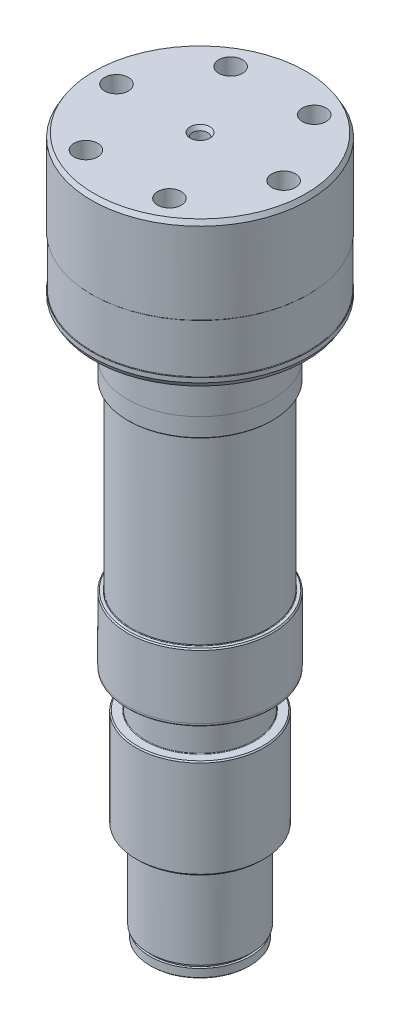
ISO-10303-21;
HEADER;
FILE_DESCRIPTION(('STEP AP214'),'2;1');
FILE_NAME('part.step','',(''),(''),'','','');
FILE_SCHEMA(('AUTOMOTIVE_DESIGN { 1 0 10303 214 1 1 1 1 }'));
ENDSEC;
DATA;
#1=APPLICATION_CONTEXT('core data for automotive mechanical design processes');
#2=APPLICATION_PROTOCOL_DEFINITION('international standard','automotive_design',2000,#1);
#3=PRODUCT_CONTEXT('',#1,'mechanical');
#4=PRODUCT('Part','Part','',(#3));
#5=PRODUCT_RELATED_PRODUCT_CATEGORY('part','',(#4));
#6=PRODUCT_DEFINITION_FORMATION('','',#4);
#7=PRODUCT_DEFINITION_CONTEXT('part definition',#1,'design');
#8=PRODUCT_DEFINITION('design','',#6,#7);
#9=PRODUCT_DEFINITION_SHAPE('','',#8);
#10=(LENGTH_UNIT() NAMED_UNIT(*) SI_UNIT(.MILLI.,.METRE.));
#11=(NAMED_UNIT(*) PLANE_ANGLE_UNIT() SI_UNIT($,.RADIAN.));
#12=(NAMED_UNIT(*) SI_UNIT($,.STERADIAN.) SOLID_ANGLE_UNIT());
#13=UNCERTAINTY_MEASURE_WITH_UNIT(LENGTH_MEASURE(1.E-05),#10,'distance_accuracy_value','');
#14=(GEOMETRIC_REPRESENTATION_CONTEXT(3) GLOBAL_UNCERTAINTY_ASSIGNED_CONTEXT((#13)) GLOBAL_UNIT_ASSIGNED_CONTEXT((#10,
#11,#12)) REPRESENTATION_CONTEXT('',''));
#15=CARTESIAN_POINT('',(0.,0.,0.));
#16=DIRECTION('',(0.,0.,1.));
#17=DIRECTION('',(1.,0.,0.));
#18=AXIS2_PLACEMENT_3D('',#15,#16,#17);
#19=CARTESIAN_POINT('',(0.,-249.408859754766,0.));
#20=DIRECTION('',(0.,-1.,0.));
#21=DIRECTION('',(0.,0.,-1.));
#22=AXIS2_PLACEMENT_3D('',#19,#20,#21);
#23=CYLINDRICAL_SURFACE('',#22,50.8254);
#24=CARTESIAN_POINT('',(0.,-141.286229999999,0.));
#25=DIRECTION('',(0.,1.,0.));
#26=DIRECTION('',(0.,0.,1.));
#27=AXIS2_PLACEMENT_3D('',#24,#25,#26);
#28=CIRCLE('',#27,50.8254);
#29=CARTESIAN_POINT('',(0.,-141.286229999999,50.8254));
#30=VERTEX_POINT('',#29);
#31=EDGE_CURVE('E372',#30,#30,#28,.F.);
#32=ORIENTED_EDGE('',*,*,#31,.T.);
#33=EDGE_LOOP('',(#32));
#34=FACE_BOUND('',#33,.T.);
#35=CARTESIAN_POINT('',(0.,-185.752740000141,0.));
#36=DIRECTION('',(0.,-1.,0.));
#37=DIRECTION('',(0.,0.,-1.));
#38=AXIS2_PLACEMENT_3D('',#35,#36,#37);
#39=CIRCLE('',#38,50.8254);
#40=CARTESIAN_POINT('',(0.,-185.752740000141,-50.8254));
#41=VERTEX_POINT('',#40);
#42=EDGE_CURVE('E159',#41,#41,#39,.T.);
#43=ORIENTED_EDGE('',*,*,#42,.F.);
#44=EDGE_LOOP('',(#43));
#45=FACE_BOUND('',#44,.T.);
#46=ADVANCED_FACE('F155',(#34,#45),#23,.T.);
#47=CARTESIAN_POINT('',(0.,-12.6999999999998,0.));
#48=DIRECTION('',(0.,1.,0.));
#49=DIRECTION('',(0.,0.,1.));
#50=AXIS2_PLACEMENT_3D('',#47,#48,#49);
#51=CONICAL_SURFACE('',#50,50.03165,0.785398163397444);
#52=CARTESIAN_POINT('',(0.,-12.6999999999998,0.));
#53=DIRECTION('',(0.,-1.,0.));
#54=DIRECTION('',(0.,0.,-1.));
#55=AXIS2_PLACEMENT_3D('',#52,#53,#54);
#56=CIRCLE('',#55,50.03165);
#57=CARTESIAN_POINT('',(0.,-12.6999999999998,-50.03165));
#58=VERTEX_POINT('',#57);
#59=EDGE_CURVE('E387',#58,#58,#56,.T.);
#60=ORIENTED_EDGE('',*,*,#59,.F.);
#61=EDGE_LOOP('',(#60));
#62=FACE_BOUND('',#61,.T.);
#63=CARTESIAN_POINT('',(0.,-11.9570499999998,0.));
#64=DIRECTION('',(0.,1.,0.));
#65=DIRECTION('',(0.,0.,1.));
#66=AXIS2_PLACEMENT_3D('',#63,#64,#65);
#67=CIRCLE('',#66,50.7746);
#68=CARTESIAN_POINT('',(0.,-11.9570499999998,50.7746));
#69=VERTEX_POINT('',#68);
#70=EDGE_CURVE('E238',#69,#69,#67,.F.);
#71=ORIENTED_EDGE('',*,*,#70,.T.);
#72=EDGE_LOOP('',(#71));
#73=FACE_BOUND('',#72,.T.);
#74=ADVANCED_FACE('F473',(#62,#73),#51,.T.);
#75=CARTESIAN_POINT('',(0.,-140.492479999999,0.));
#76=DIRECTION('',(0.,1.,0.));
#77=DIRECTION('',(0.,0.,1.));
#78=AXIS2_PLACEMENT_3D('',#75,#76,#77);
#79=PLANE('',#78);
#80=CARTESIAN_POINT('',(0.,-140.492479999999,0.));
#81=DIRECTION('',(0.,1.,0.));
#82=DIRECTION('',(0.,0.,1.));
#83=AXIS2_PLACEMENT_3D('',#80,#81,#82);
#84=CIRCLE('',#83,50.0316499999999);
#85=CARTESIAN_POINT('',(0.,-140.492479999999,50.0316499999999));
#86=VERTEX_POINT('',#85);
#87=EDGE_CURVE('E375',#86,#86,#84,.T.);
#88=ORIENTED_EDGE('',*,*,#87,.T.);
#89=EDGE_LOOP('',(#88));
#90=FACE_BOUND('',#89,.T.);
#91=CARTESIAN_POINT('',(0.,-140.492479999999,0.));
#92=DIRECTION('',(0.,1.,0.));
#93=DIRECTION('',(0.,0.,1.));
#94=AXIS2_PLACEMENT_3D('',#91,#92,#93);
#95=CIRCLE('',#94,48.047275);
#96=CARTESIAN_POINT('',(0.,-140.492479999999,48.047275));
#97=VERTEX_POINT('',#96);
#98=EDGE_CURVE('E354',#97,#97,#95,.F.);
#99=ORIENTED_EDGE('',*,*,#98,.T.);
#100=EDGE_LOOP('',(#99));
#101=FACE_BOUND('',#100,.T.);
#102=ADVANCED_FACE('F469',(#90,#101),#79,.T.);
#103=CARTESIAN_POINT('',(0.,-249.408859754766,0.));
#104=DIRECTION('',(0.,-1.,0.));
#105=DIRECTION('',(0.,0.,-1.));
#106=AXIS2_PLACEMENT_3D('',#103,#104,#105);
#107=CYLINDRICAL_SURFACE('',#106,47.6504);
#108=CARTESIAN_POINT('',(0.,-140.095604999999,0.));
#109=DIRECTION('',(0.,1.,0.));
#110=DIRECTION('',(0.,0.,1.));
#111=AXIS2_PLACEMENT_3D('',#108,#109,#110);
#112=CIRCLE('',#111,47.6504);
#113=CARTESIAN_POINT('',(0.,-140.095604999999,47.6504));
#114=VERTEX_POINT('',#113);
#115=EDGE_CURVE('E360',#114,#114,#112,.T.);
#116=ORIENTED_EDGE('',*,*,#115,.T.);
#117=EDGE_LOOP('',(#116));
#118=FACE_BOUND('',#117,.T.);
#119=CARTESIAN_POINT('',(0.,-13.0968749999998,0.));
#120=DIRECTION('',(0.,-1.,0.));
#121=DIRECTION('',(0.,0.,-1.));
#122=AXIS2_PLACEMENT_3D('',#119,#120,#121);
#123=CIRCLE('',#122,47.6504);
#124=CARTESIAN_POINT('',(0.,-13.0968749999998,-47.6504));
#125=VERTEX_POINT('',#124);
#126=EDGE_CURVE('E357',#125,#125,#123,.T.);
#127=ORIENTED_EDGE('',*,*,#126,.T.);
#128=EDGE_LOOP('',(#127));
#129=FACE_BOUND('',#128,.T.);
#130=ADVANCED_FACE('F465',(#118,#129),#107,.T.);
#131=CARTESIAN_POINT('',(0.,-12.6999999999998,0.));
#132=DIRECTION('',(0.,-1.,0.));
#133=DIRECTION('',(0.,0.,-1.));
#134=AXIS2_PLACEMENT_3D('',#131,#132,#133);
#135=PLANE('',#134);
#136=ORIENTED_EDGE('',*,*,#59,.T.);
#137=EDGE_LOOP('',(#136));
#138=FACE_BOUND('',#137,.T.);
#139=CARTESIAN_POINT('',(0.,-12.6999999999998,0.));
#140=DIRECTION('',(0.,-1.,0.));
#141=DIRECTION('',(0.,0.,-1.));
#142=AXIS2_PLACEMENT_3D('',#139,#140,#141);
#143=CIRCLE('',#142,48.047275);
#144=CARTESIAN_POINT('',(0.,-12.6999999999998,-48.047275));
#145=VERTEX_POINT('',#144);
#146=EDGE_CURVE('E363',#145,#145,#143,.F.);
#147=ORIENTED_EDGE('',*,*,#146,.T.);
#148=EDGE_LOOP('',(#147));
#149=FACE_BOUND('',#148,.T.);
#150=ADVANCED_FACE('F461',(#138,#149),#135,.T.);
#151=CARTESIAN_POINT('',(0.,-140.095604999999,0.));
#152=DIRECTION('',(0.,1.,0.));
#153=DIRECTION('',(0.,0.,1.));
#154=AXIS2_PLACEMENT_3D('',#151,#152,#153);
#155=TOROIDAL_SURFACE('',#154,48.047275,0.396875);
#156=ORIENTED_EDGE('',*,*,#115,.F.);
#157=EDGE_LOOP('',(#156));
#158=FACE_BOUND('',#157,.T.);
#159=ORIENTED_EDGE('',*,*,#98,.F.);
#160=EDGE_LOOP('',(#159));
#161=FACE_BOUND('',#160,.T.);
#162=ADVANCED_FACE('F464',(#158,#161),#155,.F.);
#163=CARTESIAN_POINT('',(0.,-13.0968749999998,0.));
#164=DIRECTION('',(0.,-1.,0.));
#165=DIRECTION('',(0.,0.,-1.));
#166=AXIS2_PLACEMENT_3D('',#163,#164,#165);
#167=TOROIDAL_SURFACE('',#166,48.047275,0.396875);
#168=ORIENTED_EDGE('',*,*,#146,.F.);
#169=EDGE_LOOP('',(#168));
#170=FACE_BOUND('',#169,.T.);
#171=ORIENTED_EDGE('',*,*,#126,.F.);
#172=EDGE_LOOP('',(#171));
#173=FACE_BOUND('',#172,.T.);
#174=ADVANCED_FACE('F811',(#170,#173),#167,.F.);
#175=CARTESIAN_POINT('',(0.,-141.286229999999,0.));
#176=DIRECTION('',(0.,-1.,0.));
#177=DIRECTION('',(0.,0.,-1.));
#178=AXIS2_PLACEMENT_3D('',#175,#176,#177);
#179=CONICAL_SURFACE('',#178,50.8254,0.785398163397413);
#180=ORIENTED_EDGE('',*,*,#87,.F.);
#181=EDGE_LOOP('',(#180));
#182=FACE_BOUND('',#181,.T.);
#183=ORIENTED_EDGE('',*,*,#31,.F.);
#184=EDGE_LOOP('',(#183));
#185=FACE_BOUND('',#184,.T.);
#186=ADVANCED_FACE('F634',(#182,#185),#179,.T.);
#187=CARTESIAN_POINT('',(0.,0.82550000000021,0.));
#188=DIRECTION('',(0.,-1.,0.));
#189=DIRECTION('',(0.,0.,-1.));
#190=AXIS2_PLACEMENT_3D('',#187,#188,#189);
#191=PLANE('',#190);
#192=CARTESIAN_POINT('',(0.,0.82550000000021,0.));
#193=DIRECTION('',(0.,-1.,0.));
#194=DIRECTION('',(0.,0.,-1.));
#195=AXIS2_PLACEMENT_3D('',#192,#193,#194);
#196=CIRCLE('',#195,50.7746);
#197=CARTESIAN_POINT('',(0.,0.82550000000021,-50.7746));
#198=VERTEX_POINT('',#197);
#199=EDGE_CURVE('E241',#198,#198,#196,.T.);
#200=ORIENTED_EDGE('',*,*,#199,.F.);
#201=EDGE_LOOP('',(#200));
#202=FACE_BOUND('',#201,.T.);
#203=CARTESIAN_POINT('',(0.,0.825500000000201,0.));
#204=DIRECTION('',(0.,-1.,0.));
#205=DIRECTION('',(0.,0.,-1.));
#206=AXIS2_PLACEMENT_3D('',#203,#204,#205);
#207=CIRCLE('',#206,50.8254);
#208=CARTESIAN_POINT('',(0.,0.825500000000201,-50.8254));
#209=VERTEX_POINT('',#208);
#210=EDGE_CURVE('E232',#209,#209,#207,.T.);
#211=ORIENTED_EDGE('',*,*,#210,.T.);
#212=EDGE_LOOP('',(#211));
#213=FACE_BOUND('',#212,.T.);
#214=ADVANCED_FACE('F631',(#202,#213),#191,.T.);
#215=CARTESIAN_POINT('',(0.,0.82550000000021,0.));
#216=DIRECTION('',(0.,-1.,0.));
#217=DIRECTION('',(0.,0.,-1.));
#218=AXIS2_PLACEMENT_3D('',#215,#216,#217);
#219=CYLINDRICAL_SURFACE('',#218,50.7746);
#220=ORIENTED_EDGE('',*,*,#70,.F.);
#221=EDGE_LOOP('',(#220));
#222=FACE_BOUND('',#221,.T.);
#223=ORIENTED_EDGE('',*,*,#199,.T.);
#224=EDGE_LOOP('',(#223));
#225=FACE_BOUND('',#224,.T.);
#226=ADVANCED_FACE('F225',(#222,#225),#219,.T.);
#227=CARTESIAN_POINT('',(0.,106.474260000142,0.));
#228=DIRECTION('',(0.,1.,0.));
#229=DIRECTION('',(0.,0.,1.));
#230=AXIS2_PLACEMENT_3D('',#227,#228,#229);
#231=CONICAL_SURFACE('',#230,5.35812999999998,1.02974425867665);
#232=CARTESIAN_POINT('',(0.,103.254770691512,0.));
#233=VERTEX_POINT('',#232);
#234=VERTEX_LOOP('',#233);
#235=FACE_BOUND('',#234,.T.);
#236=CARTESIAN_POINT('',(0.,106.474260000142,0.));
#237=DIRECTION('',(0.,1.,0.));
#238=DIRECTION('',(0.,0.,1.));
#239=AXIS2_PLACEMENT_3D('',#236,#237,#238);
#240=CIRCLE('',#239,5.35812999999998);
#241=CARTESIAN_POINT('',(0.,106.474260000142,5.35812999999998));
#242=VERTEX_POINT('',#241);
#243=EDGE_CURVE('E229',#242,#242,#240,.T.);
#244=ORIENTED_EDGE('',*,*,#243,.T.);
#245=EDGE_LOOP('',(#244));
#246=FACE_BOUND('',#245,.T.);
#247=ADVANCED_FACE('F221',(#235,#246),#231,.F.);
#248=CARTESIAN_POINT('',(-29.329393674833,91.9962600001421,50.8));
#249=DIRECTION('',(0.,1.,0.));
#250=DIRECTION('',(0.,0.,1.));
#251=AXIS2_PLACEMENT_3D('',#248,#249,#250);
#252=CONICAL_SURFACE('',#251,8.33373999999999,1.02974425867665);
#253=CARTESIAN_POINT('',(-29.329393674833,86.9888438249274,50.8));
#254=VERTEX_POINT('',#253);
#255=VERTEX_LOOP('',#254);
#256=FACE_BOUND('',#255,.T.);
#257=CARTESIAN_POINT('',(-29.329393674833,91.9962600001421,50.8));
#258=DIRECTION('',(0.,1.,0.));
#259=DIRECTION('',(0.,0.,1.));
#260=AXIS2_PLACEMENT_3D('',#257,#258,#259);
#261=CIRCLE('',#260,8.33373999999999);
#262=CARTESIAN_POINT('',(-29.329393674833,91.9962600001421,59.13374));
#263=VERTEX_POINT('',#262);
#264=EDGE_CURVE('E273',#263,#263,#261,.T.);
#265=ORIENTED_EDGE('',*,*,#264,.T.);
#266=EDGE_LOOP('',(#265));
#267=FACE_BOUND('',#266,.T.);
#268=ADVANCED_FACE('F224',(#256,#267),#252,.F.);
#269=CARTESIAN_POINT('',(-58.658787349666,91.9962600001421,0.));
#270=DIRECTION('',(0.,1.,0.));
#271=DIRECTION('',(0.,0.,1.));
#272=AXIS2_PLACEMENT_3D('',#269,#270,#271);
#273=CONICAL_SURFACE('',#272,8.33373999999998,1.02974425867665);
#274=CARTESIAN_POINT('',(-58.658787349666,86.9888438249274,0.));
#275=VERTEX_POINT('',#274);
#276=VERTEX_LOOP('',#275);
#277=FACE_BOUND('',#276,.T.);
#278=CARTESIAN_POINT('',(-58.658787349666,91.9962600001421,0.));
#279=DIRECTION('',(0.,1.,0.));
#280=DIRECTION('',(0.,0.,1.));
#281=AXIS2_PLACEMENT_3D('',#278,#279,#280);
#282=CIRCLE('',#281,8.33373999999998);
#283=CARTESIAN_POINT('',(-58.658787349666,91.9962600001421,8.33373999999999));
#284=VERTEX_POINT('',#283);
#285=EDGE_CURVE('E267',#284,#284,#282,.T.);
#286=ORIENTED_EDGE('',*,*,#285,.T.);
#287=EDGE_LOOP('',(#286));
#288=FACE_BOUND('',#287,.T.);
#289=ADVANCED_FACE('F582',(#277,#288),#273,.F.);
#290=CARTESIAN_POINT('',(-29.329393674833,91.9962600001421,-50.8));
#291=DIRECTION('',(0.,1.,0.));
#292=DIRECTION('',(0.,0.,1.));
#293=AXIS2_PLACEMENT_3D('',#290,#291,#292);
#294=CONICAL_SURFACE('',#293,8.33373999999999,1.02974425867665);
#295=CARTESIAN_POINT('',(-29.329393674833,86.9888438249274,-50.8));
#296=VERTEX_POINT('',#295);
#297=VERTEX_LOOP('',#296);
#298=FACE_BOUND('',#297,.T.);
#299=CARTESIAN_POINT('',(-29.329393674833,91.9962600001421,-50.8));
#300=DIRECTION('',(0.,1.,0.));
#301=DIRECTION('',(0.,0.,1.));
#302=AXIS2_PLACEMENT_3D('',#299,#300,#301);
#303=CIRCLE('',#302,8.33373999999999);
#304=CARTESIAN_POINT('',(-29.329393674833,91.9962600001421,-42.46626));
#305=VERTEX_POINT('',#304);
#306=EDGE_CURVE('E261',#305,#305,#303,.T.);
#307=ORIENTED_EDGE('',*,*,#306,.T.);
#308=EDGE_LOOP('',(#307));
#309=FACE_BOUND('',#308,.T.);
#310=ADVANCED_FACE('F592',(#298,#309),#294,.F.);
#311=CARTESIAN_POINT('',(29.329393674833,91.9962600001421,-50.8));
#312=DIRECTION('',(0.,1.,0.));
#313=DIRECTION('',(0.,0.,1.));
#314=AXIS2_PLACEMENT_3D('',#311,#312,#313);
#315=CONICAL_SURFACE('',#314,8.33373999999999,1.02974425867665);
#316=CARTESIAN_POINT('',(29.329393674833,86.9888438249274,-50.8));
#317=VERTEX_POINT('',#316);
#318=VERTEX_LOOP('',#317);
#319=FACE_BOUND('',#318,.T.);
#320=CARTESIAN_POINT('',(29.329393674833,91.9962600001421,-50.8));
#321=DIRECTION('',(0.,1.,0.));
#322=DIRECTION('',(0.,0.,1.));
#323=AXIS2_PLACEMENT_3D('',#320,#321,#322);
#324=CIRCLE('',#323,8.33373999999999);
#325=CARTESIAN_POINT('',(29.329393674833,91.9962600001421,-42.46626));
#326=VERTEX_POINT('',#325);
#327=EDGE_CURVE('E255',#326,#326,#324,.T.);
#328=ORIENTED_EDGE('',*,*,#327,.T.);
#329=EDGE_LOOP('',(#328));
#330=FACE_BOUND('',#329,.T.);
#331=ADVANCED_FACE('F600',(#319,#330),#315,.F.);
#332=CARTESIAN_POINT('',(58.6587873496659,91.9962600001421,0.));
#333=DIRECTION('',(0.,1.,0.));
#334=DIRECTION('',(0.,0.,1.));
#335=AXIS2_PLACEMENT_3D('',#332,#333,#334);
#336=CONICAL_SURFACE('',#335,8.33373999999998,1.02974425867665);
#337=CARTESIAN_POINT('',(58.6587873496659,86.9888438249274,0.));
#338=VERTEX_POINT('',#337);
#339=VERTEX_LOOP('',#338);
#340=FACE_BOUND('',#339,.T.);
#341=CARTESIAN_POINT('',(58.6587873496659,91.9962600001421,0.));
#342=DIRECTION('',(0.,1.,0.));
#343=DIRECTION('',(0.,0.,1.));
#344=AXIS2_PLACEMENT_3D('',#341,#342,#343);
#345=CIRCLE('',#344,8.33373999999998);
#346=CARTESIAN_POINT('',(58.6587873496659,91.9962600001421,8.33373999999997));
#347=VERTEX_POINT('',#346);
#348=EDGE_CURVE('E249',#347,#347,#345,.T.);
#349=ORIENTED_EDGE('',*,*,#348,.T.);
#350=EDGE_LOOP('',(#349));
#351=FACE_BOUND('',#350,.T.);
#352=ADVANCED_FACE('F608',(#340,#351),#336,.F.);
#353=CARTESIAN_POINT('',(29.329393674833,91.9962600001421,50.8));
#354=DIRECTION('',(0.,1.,0.));
#355=DIRECTION('',(0.,0.,1.));
#356=AXIS2_PLACEMENT_3D('',#353,#354,#355);
#357=CONICAL_SURFACE('',#356,8.33373999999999,1.02974425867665);
#358=CARTESIAN_POINT('',(29.329393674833,86.9888438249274,50.8));
#359=VERTEX_POINT('',#358);
#360=VERTEX_LOOP('',#359);
#361=FACE_BOUND('',#360,.T.);
#362=CARTESIAN_POINT('',(29.329393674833,91.9962600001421,50.8));
#363=DIRECTION('',(0.,1.,0.));
#364=DIRECTION('',(0.,0.,1.));
#365=AXIS2_PLACEMENT_3D('',#362,#363,#364);
#366=CIRCLE('',#365,8.33373999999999);
#367=CARTESIAN_POINT('',(29.329393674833,91.9962600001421,59.13374));
#368=VERTEX_POINT('',#367);
#369=EDGE_CURVE('E235',#368,#368,#366,.T.);
#370=ORIENTED_EDGE('',*,*,#369,.T.);
#371=EDGE_LOOP('',(#370));
#372=FACE_BOUND('',#371,.T.);
#373=ADVANCED_FACE('F616',(#361,#372),#357,.F.);
#374=CARTESIAN_POINT('',(0.,137.716260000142,0.));
#375=DIRECTION('',(0.,1.,0.));
#376=DIRECTION('',(0.,0.,1.));
#377=AXIS2_PLACEMENT_3D('',#374,#375,#376);
#378=CYLINDRICAL_SURFACE('',#377,5.35812999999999);
#379=CARTESIAN_POINT('',(0.,134.966629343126,0.));
#380=DIRECTION('',(0.,-1.,0.));
#381=DIRECTION('',(0.,0.,-1.));
#382=AXIS2_PLACEMENT_3D('',#379,#380,#381);
#383=CIRCLE('',#382,5.35812999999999);
#384=CARTESIAN_POINT('',(0.,134.966629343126,-5.35812999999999));
#385=VERTEX_POINT('',#384);
#386=EDGE_CURVE('E541',#385,#385,#383,.F.);
#387=ORIENTED_EDGE('',*,*,#386,.T.);
#388=EDGE_LOOP('',(#387));
#389=FACE_BOUND('',#388,.T.);
#390=ORIENTED_EDGE('',*,*,#243,.F.);
#391=EDGE_LOOP('',(#390));
#392=FACE_BOUND('',#391,.T.);
#393=ADVANCED_FACE('F588',(#389,#392),#378,.F.);
#394=CARTESIAN_POINT('',(-29.329393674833,137.716260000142,50.8));
#395=DIRECTION('',(0.,1.,0.));
#396=DIRECTION('',(0.,0.,1.));
#397=AXIS2_PLACEMENT_3D('',#394,#395,#396);
#398=CYLINDRICAL_SURFACE('',#397,8.33373999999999);
#399=ORIENTED_EDGE('',*,*,#264,.F.);
#400=EDGE_LOOP('',(#399));
#401=FACE_BOUND('',#400,.T.);
#402=CARTESIAN_POINT('',(-29.329393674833,137.716260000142,50.8));
#403=DIRECTION('',(0.,1.,0.));
#404=DIRECTION('',(0.,0.,1.));
#405=AXIS2_PLACEMENT_3D('',#402,#403,#404);
#406=CIRCLE('',#405,8.33374);
#407=CARTESIAN_POINT('',(-29.329393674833,137.716260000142,59.13374));
#408=VERTEX_POINT('',#407);
#409=EDGE_CURVE('E270',#408,#408,#406,.T.);
#410=ORIENTED_EDGE('',*,*,#409,.T.);
#411=EDGE_LOOP('',(#410));
#412=FACE_BOUND('',#411,.T.);
#413=ADVANCED_FACE('F584',(#401,#412),#398,.F.);
#414=CARTESIAN_POINT('',(-58.658787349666,137.716260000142,0.));
#415=DIRECTION('',(0.,1.,0.));
#416=DIRECTION('',(0.,0.,1.));
#417=AXIS2_PLACEMENT_3D('',#414,#415,#416);
#418=CYLINDRICAL_SURFACE('',#417,8.33373999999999);
#419=ORIENTED_EDGE('',*,*,#285,.F.);
#420=EDGE_LOOP('',(#419));
#421=FACE_BOUND('',#420,.T.);
#422=CARTESIAN_POINT('',(-58.658787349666,137.716260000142,0.));
#423=DIRECTION('',(0.,1.,0.));
#424=DIRECTION('',(0.,0.,1.));
#425=AXIS2_PLACEMENT_3D('',#422,#423,#424);
#426=CIRCLE('',#425,8.33374);
#427=CARTESIAN_POINT('',(-58.658787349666,137.716260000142,8.33374));
#428=VERTEX_POINT('',#427);
#429=EDGE_CURVE('E264',#428,#428,#426,.T.);
#430=ORIENTED_EDGE('',*,*,#429,.T.);
#431=EDGE_LOOP('',(#430));
#432=FACE_BOUND('',#431,.T.);
#433=ADVANCED_FACE('F587',(#421,#432),#418,.F.);
#434=CARTESIAN_POINT('',(-29.329393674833,137.716260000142,-50.8));
#435=DIRECTION('',(0.,1.,0.));
#436=DIRECTION('',(0.,0.,1.));
#437=AXIS2_PLACEMENT_3D('',#434,#435,#436);
#438=CYLINDRICAL_SURFACE('',#437,8.33373999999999);
#439=ORIENTED_EDGE('',*,*,#306,.F.);
#440=EDGE_LOOP('',(#439));
#441=FACE_BOUND('',#440,.T.);
#442=CARTESIAN_POINT('',(-29.329393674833,137.716260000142,-50.8));
#443=DIRECTION('',(0.,1.,0.));
#444=DIRECTION('',(0.,0.,1.));
#445=AXIS2_PLACEMENT_3D('',#442,#443,#444);
#446=CIRCLE('',#445,8.33374);
#447=CARTESIAN_POINT('',(-29.329393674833,137.716260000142,-42.46626));
#448=VERTEX_POINT('',#447);
#449=EDGE_CURVE('E258',#448,#448,#446,.T.);
#450=ORIENTED_EDGE('',*,*,#449,.T.);
#451=EDGE_LOOP('',(#450));
#452=FACE_BOUND('',#451,.T.);
#453=ADVANCED_FACE('F596',(#441,#452),#438,.F.);
#454=CARTESIAN_POINT('',(29.329393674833,137.716260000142,-50.8));
#455=DIRECTION('',(0.,1.,0.));
#456=DIRECTION('',(0.,0.,1.));
#457=AXIS2_PLACEMENT_3D('',#454,#455,#456);
#458=CYLINDRICAL_SURFACE('',#457,8.33373999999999);
#459=ORIENTED_EDGE('',*,*,#327,.F.);
#460=EDGE_LOOP('',(#459));
#461=FACE_BOUND('',#460,.T.);
#462=CARTESIAN_POINT('',(29.329393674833,137.716260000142,-50.8));
#463=DIRECTION('',(0.,1.,0.));
#464=DIRECTION('',(0.,0.,1.));
#465=AXIS2_PLACEMENT_3D('',#462,#463,#464);
#466=CIRCLE('',#465,8.33373999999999);
#467=CARTESIAN_POINT('',(29.329393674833,137.716260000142,-42.46626));
#468=VERTEX_POINT('',#467);
#469=EDGE_CURVE('E252',#468,#468,#466,.T.);
#470=ORIENTED_EDGE('',*,*,#469,.T.);
#471=EDGE_LOOP('',(#470));
#472=FACE_BOUND('',#471,.T.);
#473=ADVANCED_FACE('F604',(#461,#472),#458,.F.);
#474=CARTESIAN_POINT('',(58.6587873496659,137.716260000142,0.));
#475=DIRECTION('',(0.,1.,0.));
#476=DIRECTION('',(0.,0.,1.));
#477=AXIS2_PLACEMENT_3D('',#474,#475,#476);
#478=CYLINDRICAL_SURFACE('',#477,8.33373999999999);
#479=ORIENTED_EDGE('',*,*,#348,.F.);
#480=EDGE_LOOP('',(#479));
#481=FACE_BOUND('',#480,.T.);
#482=CARTESIAN_POINT('',(58.6587873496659,137.716260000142,0.));
#483=DIRECTION('',(0.,1.,0.));
#484=DIRECTION('',(0.,0.,1.));
#485=AXIS2_PLACEMENT_3D('',#482,#483,#484);
#486=CIRCLE('',#485,8.33374);
#487=CARTESIAN_POINT('',(58.6587873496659,137.716260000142,8.33373999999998));
#488=VERTEX_POINT('',#487);
#489=EDGE_CURVE('E246',#488,#488,#486,.T.);
#490=ORIENTED_EDGE('',*,*,#489,.T.);
#491=EDGE_LOOP('',(#490));
#492=FACE_BOUND('',#491,.T.);
#493=ADVANCED_FACE('F612',(#481,#492),#478,.F.);
#494=CARTESIAN_POINT('',(29.329393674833,137.716260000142,50.8));
#495=DIRECTION('',(0.,1.,0.));
#496=DIRECTION('',(0.,0.,1.));
#497=AXIS2_PLACEMENT_3D('',#494,#495,#496);
#498=CYLINDRICAL_SURFACE('',#497,8.33373999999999);
#499=ORIENTED_EDGE('',*,*,#369,.F.);
#500=EDGE_LOOP('',(#499));
#501=FACE_BOUND('',#500,.T.);
#502=CARTESIAN_POINT('',(29.329393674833,137.716260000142,50.8));
#503=DIRECTION('',(0.,1.,0.));
#504=DIRECTION('',(0.,0.,1.));
#505=AXIS2_PLACEMENT_3D('',#502,#503,#504);
#506=CIRCLE('',#505,8.33374);
#507=CARTESIAN_POINT('',(29.329393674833,137.716260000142,59.13374));
#508=VERTEX_POINT('',#507);
#509=EDGE_CURVE('E231',#508,#508,#506,.T.);
#510=ORIENTED_EDGE('',*,*,#509,.T.);
#511=EDGE_LOOP('',(#510));
#512=FACE_BOUND('',#511,.T.);
#513=ADVANCED_FACE('F620',(#501,#512),#498,.F.);
#514=CARTESIAN_POINT('',(0.,134.966629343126,0.));
#515=DIRECTION('',(0.,1.,0.));
#516=DIRECTION('',(0.,0.,1.));
#517=AXIS2_PLACEMENT_3D('',#514,#515,#516);
#518=CONICAL_SURFACE('',#517,5.35812999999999,0.523598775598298);
#519=CARTESIAN_POINT('',(0.,137.716260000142,0.));
#520=DIRECTION('',(0.,-1.,0.));
#521=DIRECTION('',(0.,0.,-1.));
#522=AXIS2_PLACEMENT_3D('',#519,#520,#521);
#523=CIRCLE('',#522,6.94563000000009);
#524=CARTESIAN_POINT('',(0.,137.716260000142,-6.94563000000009));
#525=VERTEX_POINT('',#524);
#526=EDGE_CURVE('E538',#525,#525,#523,.T.);
#527=ORIENTED_EDGE('',*,*,#526,.F.);
#528=EDGE_LOOP('',(#527));
#529=FACE_BOUND('',#528,.T.);
#530=ORIENTED_EDGE('',*,*,#386,.F.);
#531=EDGE_LOOP('',(#530));
#532=FACE_BOUND('',#531,.T.);
#533=ADVANCED_FACE('F441',(#529,#532),#518,.F.);
#534=CARTESIAN_POINT('',(0.,137.716260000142,0.));
#535=DIRECTION('',(0.,-1.,0.));
#536=DIRECTION('',(0.,0.,-1.));
#537=AXIS2_PLACEMENT_3D('',#534,#535,#536);
#538=PLANE('',#537);
#539=CARTESIAN_POINT('',(0.,137.716260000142,0.));
#540=DIRECTION('',(0.,-1.,0.));
#541=DIRECTION('',(0.,0.,-1.));
#542=AXIS2_PLACEMENT_3D('',#539,#540,#541);
#543=CIRCLE('',#542,74.366912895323);
#544=CARTESIAN_POINT('',(0.,137.716260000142,-74.366912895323));
#545=VERTEX_POINT('',#544);
#546=EDGE_CURVE('E532',#545,#545,#543,.F.);
#547=ORIENTED_EDGE('',*,*,#546,.T.);
#548=EDGE_LOOP('',(#547));
#549=FACE_BOUND('',#548,.T.);
#550=ORIENTED_EDGE('',*,*,#526,.T.);
#551=EDGE_LOOP('',(#550));
#552=FACE_BOUND('',#551,.T.);
#553=ORIENTED_EDGE('',*,*,#509,.F.);
#554=EDGE_LOOP('',(#553));
#555=FACE_BOUND('',#554,.T.);
#556=ORIENTED_EDGE('',*,*,#489,.F.);
#557=EDGE_LOOP('',(#556));
#558=FACE_BOUND('',#557,.T.);
#559=ORIENTED_EDGE('',*,*,#469,.F.);
#560=EDGE_LOOP('',(#559));
#561=FACE_BOUND('',#560,.T.);
#562=ORIENTED_EDGE('',*,*,#449,.F.);
#563=EDGE_LOOP('',(#562));
#564=FACE_BOUND('',#563,.T.);
#565=ORIENTED_EDGE('',*,*,#429,.F.);
#566=EDGE_LOOP('',(#565));
#567=FACE_BOUND('',#566,.T.);
#568=ORIENTED_EDGE('',*,*,#409,.F.);
#569=EDGE_LOOP('',(#568));
#570=FACE_BOUND('',#569,.T.);
#571=ADVANCED_FACE('F437',(#549,#552,#555,#558,#561,#564,#567,#570),#538,.F.);
#572=CARTESIAN_POINT('',(0.,134.541260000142,0.));
#573=DIRECTION('',(0.,-1.,0.));
#574=DIRECTION('',(0.,0.,-1.));
#575=AXIS2_PLACEMENT_3D('',#572,#573,#574);
#576=CONICAL_SURFACE('',#575,76.2,0.523598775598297);
#577=ORIENTED_EDGE('',*,*,#546,.F.);
#578=EDGE_LOOP('',(#577));
#579=FACE_BOUND('',#578,.T.);
#580=CARTESIAN_POINT('',(0.,134.541260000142,0.));
#581=DIRECTION('',(0.,-1.,0.));
#582=DIRECTION('',(0.,0.,-1.));
#583=AXIS2_PLACEMENT_3D('',#580,#581,#582);
#584=CIRCLE('',#583,76.2);
#585=CARTESIAN_POINT('',(0.,134.541260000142,-76.2));
#586=VERTEX_POINT('',#585);
#587=EDGE_CURVE('E535',#586,#586,#584,.T.);
#588=ORIENTED_EDGE('',*,*,#587,.F.);
#589=EDGE_LOOP('',(#588));
#590=FACE_BOUND('',#589,.T.);
#591=ADVANCED_FACE('F440',(#579,#590),#576,.T.);
#592=CARTESIAN_POINT('',(0.,-249.408859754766,0.));
#593=DIRECTION('',(0.,-1.,0.));
#594=DIRECTION('',(0.,0.,-1.));
#595=AXIS2_PLACEMENT_3D('',#592,#593,#594);
#596=CYLINDRICAL_SURFACE('',#595,76.2);
#597=ORIENTED_EDGE('',*,*,#587,.T.);
#598=EDGE_LOOP('',(#597));
#599=FACE_BOUND('',#598,.T.);
#600=CARTESIAN_POINT('',(0.,77.3912600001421,0.));
#601=DIRECTION('',(0.,1.,0.));
#602=DIRECTION('',(0.,0.,1.));
#603=AXIS2_PLACEMENT_3D('',#600,#601,#602);
#604=CIRCLE('',#603,76.2);
#605=CARTESIAN_POINT('',(0.,77.3912600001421,76.2));
#606=VERTEX_POINT('',#605);
#607=EDGE_CURVE('E303',#606,#606,#604,.T.);
#608=ORIENTED_EDGE('',*,*,#607,.T.);
#609=EDGE_LOOP('',(#608));
#610=FACE_BOUND('',#609,.T.);
#611=ADVANCED_FACE('F443',(#599,#610),#596,.T.);
#612=CARTESIAN_POINT('',(0.,77.0024035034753,0.));
#613=DIRECTION('',(0.,1.,0.));
#614=DIRECTION('',(0.,0.,1.));
#615=AXIS2_PLACEMENT_3D('',#612,#613,#614);
#616=TOROIDAL_SURFACE('',#615,76.279375,0.396875);
#617=CARTESIAN_POINT('',(0.,77.0024035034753,0.));
#618=DIRECTION('',(0.,1.,0.));
#619=DIRECTION('',(0.,0.,1.));
#620=AXIS2_PLACEMENT_3D('',#617,#618,#619);
#621=CIRCLE('',#620,75.8825);
#622=CARTESIAN_POINT('',(0.,77.0024035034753,75.8825));
#623=VERTEX_POINT('',#622);
#624=EDGE_CURVE('E333',#623,#623,#621,.F.);
#625=ORIENTED_EDGE('',*,*,#624,.F.);
#626=EDGE_LOOP('',(#625));
#627=FACE_BOUND('',#626,.T.);
#628=ORIENTED_EDGE('',*,*,#607,.F.);
#629=EDGE_LOOP('',(#628));
#630=FACE_BOUND('',#629,.T.);
#631=ADVANCED_FACE('F429',(#627,#630),#616,.F.);
#632=CARTESIAN_POINT('',(0.,137.716260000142,0.));
#633=DIRECTION('',(0.,1.,0.));
#634=DIRECTION('',(0.,0.,1.));
#635=AXIS2_PLACEMENT_3D('',#632,#633,#634);
#636=CYLINDRICAL_SURFACE('',#635,75.8825);
#637=ORIENTED_EDGE('',*,*,#624,.T.);
#638=EDGE_LOOP('',(#637));
#639=FACE_BOUND('',#638,.T.);
#640=CARTESIAN_POINT('',(0.,42.855116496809,0.));
#641=DIRECTION('',(0.,-1.,0.));
#642=DIRECTION('',(0.,0.,-1.));
#643=AXIS2_PLACEMENT_3D('',#640,#641,#642);
#644=CIRCLE('',#643,75.8825);
#645=CARTESIAN_POINT('',(0.,42.855116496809,-75.8825));
#646=VERTEX_POINT('',#645);
#647=EDGE_CURVE('E330',#646,#646,#644,.F.);
#648=ORIENTED_EDGE('',*,*,#647,.T.);
#649=EDGE_LOOP('',(#648));
#650=FACE_BOUND('',#649,.T.);
#651=ADVANCED_FACE('F425',(#639,#650),#636,.T.);
#652=CARTESIAN_POINT('',(0.,42.855116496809,0.));
#653=DIRECTION('',(0.,-1.,0.));
#654=DIRECTION('',(0.,0.,-1.));
#655=AXIS2_PLACEMENT_3D('',#652,#653,#654);
#656=TOROIDAL_SURFACE('',#655,76.279375,0.396875);
#657=CARTESIAN_POINT('',(0.,42.4662600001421,0.));
#658=DIRECTION('',(0.,1.,0.));
#659=DIRECTION('',(0.,0.,1.));
#660=AXIS2_PLACEMENT_3D('',#657,#658,#659);
#661=CIRCLE('',#660,76.2);
#662=CARTESIAN_POINT('',(0.,42.4662600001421,76.2));
#663=VERTEX_POINT('',#662);
#664=EDGE_CURVE('E294',#663,#663,#661,.T.);
#665=ORIENTED_EDGE('',*,*,#664,.T.);
#666=EDGE_LOOP('',(#665));
#667=FACE_BOUND('',#666,.T.);
#668=ORIENTED_EDGE('',*,*,#647,.F.);
#669=EDGE_LOOP('',(#668));
#670=FACE_BOUND('',#669,.T.);
#671=ADVANCED_FACE('F428',(#667,#670),#656,.F.);
#672=CARTESIAN_POINT('',(0.,39.2912600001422,0.));
#673=DIRECTION('',(0.,-1.,0.));
#674=DIRECTION('',(0.,0.,-1.));
#675=AXIS2_PLACEMENT_3D('',#672,#673,#674);
#676=CIRCLE('',#675,76.2);
#677=CARTESIAN_POINT('',(0.,39.2912600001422,-76.2));
#678=VERTEX_POINT('',#677);
#679=EDGE_CURVE('E306',#678,#678,#676,.T.);
#680=ORIENTED_EDGE('',*,*,#679,.F.);
#681=EDGE_LOOP('',(#680));
#682=FACE_BOUND('',#681,.T.);
#683=ORIENTED_EDGE('',*,*,#664,.F.);
#684=EDGE_LOOP('',(#683));
#685=FACE_BOUND('',#684,.T.);
#686=ADVANCED_FACE('F447',(#682,#685),#596,.T.);
#687=CARTESIAN_POINT('',(0.,39.2912600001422,0.));
#688=DIRECTION('',(0.,1.,0.));
#689=DIRECTION('',(0.,0.,1.));
#690=AXIS2_PLACEMENT_3D('',#687,#688,#689);
#691=CONICAL_SURFACE('',#690,76.2,0.5235987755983);
#692=CARTESIAN_POINT('',(0.,36.1162600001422,0.));
#693=DIRECTION('',(0.,-1.,0.));
#694=DIRECTION('',(0.,0.,-1.));
#695=AXIS2_PLACEMENT_3D('',#692,#693,#694);
#696=CIRCLE('',#695,74.366912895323);
#697=CARTESIAN_POINT('',(0.,36.1162600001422,-74.366912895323));
#698=VERTEX_POINT('',#697);
#699=EDGE_CURVE('E309',#698,#698,#696,.T.);
#700=ORIENTED_EDGE('',*,*,#699,.F.);
#701=EDGE_LOOP('',(#700));
#702=FACE_BOUND('',#701,.T.);
#703=ORIENTED_EDGE('',*,*,#679,.T.);
#704=EDGE_LOOP('',(#703));
#705=FACE_BOUND('',#704,.T.);
#706=ADVANCED_FACE('F448',(#702,#705),#691,.T.);
#707=CARTESIAN_POINT('',(-7.77108230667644E-13,36.1162600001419,0.));
#708=DIRECTION('',(0.,1.,0.));
#709=DIRECTION('',(0.,0.,1.));
#710=AXIS2_PLACEMENT_3D('',#707,#708,#709);
#711=PLANE('',#710);
#712=CARTESIAN_POINT('',(0.,36.1162600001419,0.));
#713=DIRECTION('',(0.,1.,0.));
#714=DIRECTION('',(0.,0.,1.));
#715=AXIS2_PLACEMENT_3D('',#712,#713,#714);
#716=CIRCLE('',#715,54.0004);
#717=CARTESIAN_POINT('',(0.,36.1162600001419,54.0004));
#718=VERTEX_POINT('',#717);
#719=EDGE_CURVE('E12',#718,#718,#716,.T.);
#720=ORIENTED_EDGE('',*,*,#719,.T.);
#721=EDGE_LOOP('',(#720));
#722=FACE_BOUND('',#721,.T.);
#723=ORIENTED_EDGE('',*,*,#699,.T.);
#724=EDGE_LOOP('',(#723));
#725=FACE_BOUND('',#724,.T.);
#726=ADVANCED_FACE('F451',(#722,#725),#711,.F.);
#727=CARTESIAN_POINT('',(0.,32.9412600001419,0.));
#728=DIRECTION('',(0.,1.,0.));
#729=DIRECTION('',(0.,0.,1.));
#730=AXIS2_PLACEMENT_3D('',#727,#728,#729);
#731=TOROIDAL_SURFACE('',#730,54.0004,3.175);
#732=ORIENTED_EDGE('',*,*,#719,.F.);
#733=EDGE_LOOP('',(#732));
#734=FACE_BOUND('',#733,.T.);
#735=CARTESIAN_POINT('',(0.,32.9412600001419,0.));
#736=DIRECTION('',(0.,1.,0.));
#737=DIRECTION('',(0.,0.,1.));
#738=AXIS2_PLACEMENT_3D('',#735,#736,#737);
#739=CIRCLE('',#738,50.8254);
#740=CARTESIAN_POINT('',(0.,32.9412600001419,50.8254));
#741=VERTEX_POINT('',#740);
#742=EDGE_CURVE('E164',#741,#741,#739,.F.);
#743=ORIENTED_EDGE('',*,*,#742,.F.);
#744=EDGE_LOOP('',(#743));
#745=FACE_BOUND('',#744,.T.);
#746=ADVANCED_FACE('F157',(#734,#745),#731,.F.);
#747=ORIENTED_EDGE('',*,*,#742,.T.);
#748=EDGE_LOOP('',(#747));
#749=FACE_BOUND('',#748,.T.);
#750=ORIENTED_EDGE('',*,*,#210,.F.);
#751=EDGE_LOOP('',(#750));
#752=FACE_BOUND('',#751,.T.);
#753=ADVANCED_FACE('F456',(#749,#752),#23,.T.);
#754=CARTESIAN_POINT('',(0.,-185.752740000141,0.));
#755=DIRECTION('',(0.,-1.,0.));
#756=DIRECTION('',(0.,0.,-1.));
#757=AXIS2_PLACEMENT_3D('',#754,#755,#756);
#758=PLANE('',#757);
#759=CARTESIAN_POINT('',(0.,-185.752740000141,0.));
#760=DIRECTION('',(0.,-1.,0.));
#761=DIRECTION('',(0.,0.,-1.));
#762=AXIS2_PLACEMENT_3D('',#759,#760,#761);
#763=CIRCLE('',#762,50.7746);
#764=CARTESIAN_POINT('',(0.,-185.752740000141,-50.7746));
#765=VERTEX_POINT('',#764);
#766=EDGE_CURVE('E523',#765,#765,#763,.T.);
#767=ORIENTED_EDGE('',*,*,#766,.F.);
#768=EDGE_LOOP('',(#767));
#769=FACE_BOUND('',#768,.T.);
#770=ORIENTED_EDGE('',*,*,#42,.T.);
#771=EDGE_LOOP('',(#770));
#772=FACE_BOUND('',#771,.T.);
#773=ADVANCED_FACE('F459',(#769,#772),#758,.T.);
#774=CARTESIAN_POINT('',(0.,-185.752740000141,0.));
#775=DIRECTION('',(0.,-1.,0.));
#776=DIRECTION('',(0.,0.,-1.));
#777=AXIS2_PLACEMENT_3D('',#774,#775,#776);
#778=CYLINDRICAL_SURFACE('',#777,50.7746);
#779=CARTESIAN_POINT('',(0.,-186.978290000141,0.));
#780=DIRECTION('',(0.,1.,0.));
#781=DIRECTION('',(0.,0.,1.));
#782=AXIS2_PLACEMENT_3D('',#779,#780,#781);
#783=CIRCLE('',#782,50.7746);
#784=CARTESIAN_POINT('',(0.,-186.978290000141,50.7746));
#785=VERTEX_POINT('',#784);
#786=EDGE_CURVE('E520',#785,#785,#783,.F.);
#787=ORIENTED_EDGE('',*,*,#786,.F.);
#788=EDGE_LOOP('',(#787));
#789=FACE_BOUND('',#788,.T.);
#790=ORIENTED_EDGE('',*,*,#766,.T.);
#791=EDGE_LOOP('',(#790));
#792=FACE_BOUND('',#791,.T.);
#793=ADVANCED_FACE('F575',(#789,#792),#778,.T.);
#794=CARTESIAN_POINT('',(0.,-320.87924000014,0.));
#795=DIRECTION('',(0.,-1.,0.));
#796=DIRECTION('',(0.,0.,-1.));
#797=AXIS2_PLACEMENT_3D('',#794,#795,#796);
#798=CONICAL_SURFACE('',#797,5.35812999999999,1.02974425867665);
#799=CARTESIAN_POINT('',(0.,-317.65975069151,0.));
#800=VERTEX_POINT('',#799);
#801=VERTEX_LOOP('',#800);
#802=FACE_BOUND('',#801,.T.);
#803=CARTESIAN_POINT('',(0.,-320.87924000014,0.));
#804=DIRECTION('',(0.,-1.,0.));
#805=DIRECTION('',(0.,0.,-1.));
#806=AXIS2_PLACEMENT_3D('',#803,#804,#805);
#807=CIRCLE('',#806,5.35812999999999);
#808=CARTESIAN_POINT('',(0.,-320.87924000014,-5.35812999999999));
#809=VERTEX_POINT('',#808);
#810=EDGE_CURVE('E276',#809,#809,#807,.T.);
#811=ORIENTED_EDGE('',*,*,#810,.T.);
#812=EDGE_LOOP('',(#811));
#813=FACE_BOUND('',#812,.T.);
#814=ADVANCED_FACE('F571',(#802,#813),#798,.F.);
#815=CARTESIAN_POINT('',(0.,-352.12124000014,0.));
#816=DIRECTION('',(0.,-1.,0.));
#817=DIRECTION('',(0.,0.,-1.));
#818=AXIS2_PLACEMENT_3D('',#815,#816,#817);
#819=CYLINDRICAL_SURFACE('',#818,5.35813);
#820=CARTESIAN_POINT('',(0.,-349.371609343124,0.));
#821=DIRECTION('',(0.,1.,0.));
#822=DIRECTION('',(0.,0.,1.));
#823=AXIS2_PLACEMENT_3D('',#820,#821,#822);
#824=CIRCLE('',#823,5.35813);
#825=CARTESIAN_POINT('',(0.,-349.371609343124,5.35813));
#826=VERTEX_POINT('',#825);
#827=EDGE_CURVE('E547',#826,#826,#824,.F.);
#828=ORIENTED_EDGE('',*,*,#827,.T.);
#829=EDGE_LOOP('',(#828));
#830=FACE_BOUND('',#829,.T.);
#831=ORIENTED_EDGE('',*,*,#810,.F.);
#832=EDGE_LOOP('',(#831));
#833=FACE_BOUND('',#832,.T.);
#834=ADVANCED_FACE('F574',(#830,#833),#819,.F.);
#835=CARTESIAN_POINT('',(0.,-349.371609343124,0.));
#836=DIRECTION('',(0.,-1.,0.));
#837=DIRECTION('',(0.,0.,-1.));
#838=AXIS2_PLACEMENT_3D('',#835,#836,#837);
#839=CONICAL_SURFACE('',#838,5.35813,0.523598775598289);
#840=CARTESIAN_POINT('',(0.,-352.12124000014,0.));
#841=DIRECTION('',(0.,1.,0.));
#842=DIRECTION('',(0.,0.,1.));
#843=AXIS2_PLACEMENT_3D('',#840,#841,#842);
#844=CIRCLE('',#843,6.94563000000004);
#845=CARTESIAN_POINT('',(0.,-352.12124000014,6.94563000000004));
#846=VERTEX_POINT('',#845);
#847=EDGE_CURVE('E544',#846,#846,#844,.T.);
#848=ORIENTED_EDGE('',*,*,#847,.F.);
#849=EDGE_LOOP('',(#848));
#850=FACE_BOUND('',#849,.T.);
#851=ORIENTED_EDGE('',*,*,#827,.F.);
#852=EDGE_LOOP('',(#851));
#853=FACE_BOUND('',#852,.T.);
#854=ADVANCED_FACE('F435',(#850,#853),#839,.F.);
#855=CARTESIAN_POINT('',(0.,-352.12124000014,0.));
#856=DIRECTION('',(0.,1.,0.));
#857=DIRECTION('',(0.,0.,1.));
#858=AXIS2_PLACEMENT_3D('',#855,#856,#857);
#859=PLANE('',#858);
#860=ORIENTED_EDGE('',*,*,#847,.T.);
#861=EDGE_LOOP('',(#860));
#862=FACE_BOUND('',#861,.T.);
#863=CARTESIAN_POINT('',(0.,-352.12124000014,0.));
#864=DIRECTION('',(0.,1.,0.));
#865=DIRECTION('',(0.,0.,1.));
#866=AXIS2_PLACEMENT_3D('',#863,#864,#865);
#867=CIRCLE('',#866,34.2062499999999);
#868=CARTESIAN_POINT('',(0.,-352.12124000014,34.2062499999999));
#869=VERTEX_POINT('',#868);
#870=EDGE_CURVE('E366',#869,#869,#867,.F.);
#871=ORIENTED_EDGE('',*,*,#870,.T.);
#872=EDGE_LOOP('',(#871));
#873=FACE_BOUND('',#872,.T.);
#874=ADVANCED_FACE('F431',(#862,#873),#859,.F.);
#875=CARTESIAN_POINT('',(0.,-352.12124000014,0.));
#876=DIRECTION('',(0.,1.,0.));
#877=DIRECTION('',(0.,0.,1.));
#878=AXIS2_PLACEMENT_3D('',#875,#876,#877);
#879=CONICAL_SURFACE('',#878,34.2062499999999,0.785398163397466);
#880=CARTESIAN_POINT('',(0.,-351.32749000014,0.));
#881=DIRECTION('',(0.,1.,0.));
#882=DIRECTION('',(0.,0.,1.));
#883=AXIS2_PLACEMENT_3D('',#880,#881,#882);
#884=CIRCLE('',#883,35.);
#885=CARTESIAN_POINT('',(0.,-351.32749000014,35.));
#886=VERTEX_POINT('',#885);
#887=EDGE_CURVE('E369',#886,#886,#884,.T.);
#888=ORIENTED_EDGE('',*,*,#887,.F.);
#889=EDGE_LOOP('',(#888));
#890=FACE_BOUND('',#889,.T.);
#891=ORIENTED_EDGE('',*,*,#870,.F.);
#892=EDGE_LOOP('',(#891));
#893=FACE_BOUND('',#892,.T.);
#894=ADVANCED_FACE('F434',(#890,#893),#879,.T.);
#895=CARTESIAN_POINT('',(0.,-249.408859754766,0.));
#896=DIRECTION('',(0.,-1.,0.));
#897=DIRECTION('',(0.,0.,-1.));
#898=AXIS2_PLACEMENT_3D('',#895,#896,#897);
#899=CYLINDRICAL_SURFACE('',#898,35.);
#900=ORIENTED_EDGE('',*,*,#887,.T.);
#901=EDGE_LOOP('',(#900));
#902=FACE_BOUND('',#901,.T.);
#903=CARTESIAN_POINT('',(0.,-345.77124000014,0.));
#904=DIRECTION('',(0.,-1.,0.));
#905=DIRECTION('',(0.,0.,-1.));
#906=AXIS2_PLACEMENT_3D('',#903,#904,#905);
#907=CIRCLE('',#906,35.);
#908=CARTESIAN_POINT('',(0.,-345.77124000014,-35.));
#909=VERTEX_POINT('',#908);
#910=EDGE_CURVE('E327',#909,#909,#907,.T.);
#911=ORIENTED_EDGE('',*,*,#910,.T.);
#912=EDGE_LOOP('',(#911));
#913=FACE_BOUND('',#912,.T.);
#914=ADVANCED_FACE('F677',(#902,#913),#899,.T.);
#915=CARTESIAN_POINT('',(0.,-345.77124000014,0.));
#916=DIRECTION('',(0.,1.,0.));
#917=DIRECTION('',(0.,0.,1.));
#918=AXIS2_PLACEMENT_3D('',#915,#916,#917);
#919=PLANE('',#918);
#920=CARTESIAN_POINT('',(0.,-345.77124000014,0.));
#921=DIRECTION('',(0.,-1.,0.));
#922=DIRECTION('',(0.,0.,-1.));
#923=AXIS2_PLACEMENT_3D('',#920,#921,#922);
#924=CIRCLE('',#923,33.5);
#925=CARTESIAN_POINT('',(0.,-345.77124000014,-33.5));
#926=VERTEX_POINT('',#925);
#927=EDGE_CURVE('E324',#926,#926,#924,.T.);
#928=ORIENTED_EDGE('',*,*,#927,.T.);
#929=EDGE_LOOP('',(#928));
#930=FACE_BOUND('',#929,.T.);
#931=ORIENTED_EDGE('',*,*,#910,.F.);
#932=EDGE_LOOP('',(#931));
#933=FACE_BOUND('',#932,.T.);
#934=ADVANCED_FACE('F567',(#930,#933),#919,.T.);
#935=CARTESIAN_POINT('',(0.,-249.408859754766,0.));
#936=DIRECTION('',(0.,-1.,0.));
#937=DIRECTION('',(0.,0.,-1.));
#938=AXIS2_PLACEMENT_3D('',#935,#936,#937);
#939=CYLINDRICAL_SURFACE('',#938,33.5);
#940=CARTESIAN_POINT('',(0.,-343.12124000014,0.));
#941=DIRECTION('',(0.,-1.,0.));
#942=DIRECTION('',(0.,0.,-1.));
#943=AXIS2_PLACEMENT_3D('',#940,#941,#942);
#944=CIRCLE('',#943,33.5);
#945=CARTESIAN_POINT('',(0.,-343.12124000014,-33.5));
#946=VERTEX_POINT('',#945);
#947=EDGE_CURVE('E321',#946,#946,#944,.T.);
#948=ORIENTED_EDGE('',*,*,#947,.T.);
#949=EDGE_LOOP('',(#948));
#950=FACE_BOUND('',#949,.T.);
#951=ORIENTED_EDGE('',*,*,#927,.F.);
#952=EDGE_LOOP('',(#951));
#953=FACE_BOUND('',#952,.T.);
#954=ADVANCED_FACE('F561',(#950,#953),#939,.T.);
#955=CARTESIAN_POINT('',(0.,-299.47884000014,-28.987300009));
#956=DIRECTION('',(0.,0.,-1.));
#957=DIRECTION('',(-1.,0.,0.));
#958=AXIS2_PLACEMENT_3D('',#955,#956,#957);
#959=PLANE('',#958);
#960=CARTESIAN_POINT('',(0.,-299.47884000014,-28.987300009));
#961=DIRECTION('',(0.,0.,-1.));
#962=DIRECTION('',(-1.,0.,0.));
#963=AXIS2_PLACEMENT_3D('',#960,#961,#962);
#964=CIRCLE('',#963,10.0076);
#965=CARTESIAN_POINT('',(-10.0076,-299.47884000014,-28.987300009));
#966=VERTEX_POINT('',#965);
#967=CARTESIAN_POINT('',(10.0076,-299.47884000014,-28.987300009));
#968=VERTEX_POINT('',#967);
#969=EDGE_CURVE('E279',#966,#968,#964,.T.);
#970=ORIENTED_EDGE('',*,*,#969,.T.);
#971=DIRECTION('',(0.,-1.,0.));
#972=VECTOR('',#971,1.);
#973=CARTESIAN_POINT('',(10.0076,-299.47884000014,-28.987300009));
#974=LINE('',#973,#972);
#975=CARTESIAN_POINT('',(10.0076,-324.87884000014,-28.987300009));
#976=VERTEX_POINT('',#975);
#977=EDGE_CURVE('E282',#968,#976,#974,.T.);
#978=ORIENTED_EDGE('',*,*,#977,.T.);
#979=CARTESIAN_POINT('',(0.,-324.87884000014,-28.987300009));
#980=DIRECTION('',(0.,0.,-1.));
#981=DIRECTION('',(-1.,0.,0.));
#982=AXIS2_PLACEMENT_3D('',#979,#980,#981);
#983=CIRCLE('',#982,10.0076);
#984=CARTESIAN_POINT('',(-10.0076,-324.87884000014,-28.987300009));
#985=VERTEX_POINT('',#984);
#986=EDGE_CURVE('E285',#976,#985,#983,.T.);
#987=ORIENTED_EDGE('',*,*,#986,.T.);
#988=DIRECTION('',(0.,1.,0.));
#989=VECTOR('',#988,1.);
#990=CARTESIAN_POINT('',(-10.0076,-299.47884000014,-28.987300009));
#991=LINE('',#990,#989);
#992=EDGE_CURVE('E288',#985,#966,#991,.T.);
#993=ORIENTED_EDGE('',*,*,#992,.T.);
#994=EDGE_LOOP('',(#970,#978,#987,#993));
#995=FACE_BOUND('',#994,.T.);
#996=ADVANCED_FACE('F558',(#995),#959,.T.);
#997=CARTESIAN_POINT('',(0.,-343.12124000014,0.));
#998=DIRECTION('',(0.,-1.,0.));
#999=DIRECTION('',(0.,0.,-1.));
#1000=AXIS2_PLACEMENT_3D('',#997,#998,#999);
#1001=PLANE('',#1000);
#1002=CARTESIAN_POINT('',(0.,-343.12124000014,0.));
#1003=DIRECTION('',(0.,-1.,0.));
#1004=DIRECTION('',(0.,0.,-1.));
#1005=AXIS2_PLACEMENT_3D('',#1002,#1003,#1004);
#1006=CIRCLE('',#1005,35.987300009);
#1007=CARTESIAN_POINT('',(0.,-343.12124000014,-35.987300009));
#1008=VERTEX_POINT('',#1007);
#1009=EDGE_CURVE('E318',#1008,#1008,#1006,.T.);
#1010=ORIENTED_EDGE('',*,*,#1009,.T.);
#1011=EDGE_LOOP('',(#1010));
#1012=FACE_BOUND('',#1011,.T.);
#1013=ORIENTED_EDGE('',*,*,#947,.F.);
#1014=EDGE_LOOP('',(#1013));
#1015=FACE_BOUND('',#1014,.T.);
#1016=ADVANCED_FACE('F424',(#1012,#1015),#1001,.T.);
#1017=CARTESIAN_POINT('',(0.,-299.47884000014,-28.987300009));
#1018=DIRECTION('',(0.,0.,-1.));
#1019=DIRECTION('',(-1.,0.,0.));
#1020=AXIS2_PLACEMENT_3D('',#1017,#1018,#1019);
#1021=CYLINDRICAL_SURFACE('',#1020,10.0076);
#1022=DIRECTION('',(0.,0.,-1.));
#1023=VECTOR('',#1022,1.);
#1024=CARTESIAN_POINT('',(10.0076,-299.47884000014,-28.987300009));
#1025=LINE('',#1024,#1023);
#1026=CARTESIAN_POINT('',(10.0076,-299.47884000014,-34.5678131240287));
#1027=VERTEX_POINT('',#1026);
#1028=EDGE_CURVE('E291',#968,#1027,#1025,.T.);
#1029=ORIENTED_EDGE('',*,*,#1028,.F.);
#1030=ORIENTED_EDGE('',*,*,#969,.F.);
#1031=DIRECTION('',(0.,0.,-1.));
#1032=VECTOR('',#1031,1.);
#1033=CARTESIAN_POINT('',(-10.0076,-299.47884000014,-28.987300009));
#1034=LINE('',#1033,#1032);
#1035=CARTESIAN_POINT('',(-10.0076,-299.47884000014,-34.5678131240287));
#1036=VERTEX_POINT('',#1035);
#1037=EDGE_CURVE('E292',#966,#1036,#1034,.T.);
#1038=ORIENTED_EDGE('',*,*,#1037,.T.);
#1039=CARTESIAN_POINT('',(10.0076,-299.47884000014,-34.5678131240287));
#1040=CARTESIAN_POINT('',(10.0076362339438,-299.203214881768,-34.5677770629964));
#1041=CARTESIAN_POINT('',(9.99621490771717,-298.927602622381,-34.5711084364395));
#1042=CARTESIAN_POINT('',(9.9507246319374,-298.37846176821,-34.5842431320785));
#1043=CARTESIAN_POINT('',(9.91666017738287,-298.104932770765,-34.5940451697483));
#1044=CARTESIAN_POINT('',(9.82625388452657,-297.562522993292,-34.619829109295));
#1045=CARTESIAN_POINT('',(9.76996289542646,-297.293633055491,-34.6357969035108));
#1046=CARTESIAN_POINT('',(9.6355980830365,-296.761758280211,-34.6734178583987));
#1047=CARTESIAN_POINT('',(9.557523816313,-296.498773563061,-34.6950711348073));
#1048=CARTESIAN_POINT('',(9.38027455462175,-295.980633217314,-34.7434112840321));
#1049=CARTESIAN_POINT('',(9.28110929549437,-295.72547403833,-34.7700958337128));
#1050=CARTESIAN_POINT('',(9.06239009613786,-295.22444340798,-34.8277423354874));
#1051=CARTESIAN_POINT('',(8.9428286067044,-294.978575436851,-34.8587058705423));
#1052=CARTESIAN_POINT('',(8.6842029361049,-294.49775497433,-34.924034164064));
#1053=CARTESIAN_POINT('',(8.54513610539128,-294.262803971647,-34.9583993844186));
#1054=CARTESIAN_POINT('',(8.24846959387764,-293.805292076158,-35.029584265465));
#1055=CARTESIAN_POINT('',(8.09086899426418,-293.58273179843,-35.0664040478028));
#1056=CARTESIAN_POINT('',(7.75410783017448,-293.146089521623,-35.1424256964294));
#1057=CARTESIAN_POINT('',(7.57451474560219,-292.932347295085,-35.1816637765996));
#1058=CARTESIAN_POINT('',(7.19815384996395,-292.520648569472,-35.2605913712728));
#1059=CARTESIAN_POINT('',(7.00138580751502,-292.322692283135,-35.3002808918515));
#1060=CARTESIAN_POINT('',(6.5919017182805,-291.943807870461,-35.379034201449));
#1061=CARTESIAN_POINT('',(6.37918283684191,-291.762882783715,-35.4180978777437));
#1062=CARTESIAN_POINT('',(5.93918672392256,-291.41930982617,-35.4945301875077));
#1063=CARTESIAN_POINT('',(5.71190990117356,-291.256661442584,-35.5318988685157));
#1064=CARTESIAN_POINT('',(5.24007573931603,-290.948040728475,-35.6045691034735));
#1065=CARTESIAN_POINT('',(4.99528279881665,-290.802416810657,-35.639822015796));
#1066=CARTESIAN_POINT('',(4.49386370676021,-290.532427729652,-35.7065103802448));
#1067=CARTESIAN_POINT('',(4.23724217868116,-290.408054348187,-35.7379473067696));
#1068=CARTESIAN_POINT('',(3.71386040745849,-290.181495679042,-35.7961216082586));
#1069=CARTESIAN_POINT('',(3.44710002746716,-290.079310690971,-35.822858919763));
#1070=CARTESIAN_POINT('',(2.90537497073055,-289.898003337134,-35.8708584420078));
#1071=CARTESIAN_POINT('',(2.63041053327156,-289.818880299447,-35.8921208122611));
#1072=CARTESIAN_POINT('',(2.08122873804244,-289.686068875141,-35.9280960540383));
#1073=CARTESIAN_POINT('',(1.80716181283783,-289.631798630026,-35.942958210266));
#1074=CARTESIAN_POINT('',(1.25518785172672,-289.54634028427,-35.9664644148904));
#1075=CARTESIAN_POINT('',(0.977280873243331,-289.51515183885,-35.9751085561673));
#1076=CARTESIAN_POINT('',(0.419743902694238,-289.47614258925,-35.9859320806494));
#1077=CARTESIAN_POINT('',(0.140114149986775,-289.468318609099,-35.9881123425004));
#1078=CARTESIAN_POINT('',(-0.418791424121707,-289.476101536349,-35.9859481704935));
#1079=CARTESIAN_POINT('',(-0.698067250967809,-289.491708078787,-35.9816038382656));
#1080=CARTESIAN_POINT('',(-1.24651884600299,-289.545458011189,-35.9667226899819));
#1081=CARTESIAN_POINT('',(-1.51576140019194,-289.582970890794,-35.9563591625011));
#1082=CARTESIAN_POINT('',(-2.05002317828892,-289.6796993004,-35.9298580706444));
#1083=CARTESIAN_POINT('',(-2.31504249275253,-289.738914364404,-35.9137206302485));
#1084=CARTESIAN_POINT('',(-2.83899775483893,-289.878545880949,-35.8761039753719));
#1085=CARTESIAN_POINT('',(-3.09793465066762,-289.958959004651,-35.8546255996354));
#1086=CARTESIAN_POINT('',(-3.60813916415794,-290.140385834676,-35.8068816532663));
#1087=CARTESIAN_POINT('',(-3.8594038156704,-290.241407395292,-35.7806142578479));
#1088=CARTESIAN_POINT('',(-4.35503907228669,-290.464391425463,-35.7236931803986));
#1089=CARTESIAN_POINT('',(-4.5993141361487,-290.586555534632,-35.6929977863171));
#1090=CARTESIAN_POINT('',(-5.0768328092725,-290.850267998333,-35.6282138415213));
#1091=CARTESIAN_POINT('',(-5.31007144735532,-290.991824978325,-35.5941237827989));
#1092=CARTESIAN_POINT('',(-5.76399431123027,-291.293323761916,-35.523441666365));
#1093=CARTESIAN_POINT('',(-5.98467661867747,-291.453268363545,-35.4868492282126));
#1094=CARTESIAN_POINT('',(-6.41201834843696,-291.790399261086,-35.4121282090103));
#1095=CARTESIAN_POINT('',(-6.61868350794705,-291.967578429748,-35.3740002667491));
#1096=CARTESIAN_POINT('',(-7.02354785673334,-292.344356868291,-35.2958845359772));
#1097=CARTESIAN_POINT('',(-7.22122835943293,-292.54450985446,-35.2558773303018));
#1098=CARTESIAN_POINT('',(-7.59902760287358,-292.960726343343,-35.176381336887));
#1099=CARTESIAN_POINT('',(-7.77915208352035,-293.176784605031,-35.1368923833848));
#1100=CARTESIAN_POINT('',(-8.12078757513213,-293.623586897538,-35.0595104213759));
#1101=CARTESIAN_POINT('',(-8.28228967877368,-293.854337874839,-35.0216181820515));
#1102=CARTESIAN_POINT('',(-8.58544063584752,-294.328932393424,-34.9485377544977));
#1103=CARTESIAN_POINT('',(-8.72709009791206,-294.572775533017,-34.9133494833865));
#1104=CARTESIAN_POINT('',(-8.99051680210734,-295.073908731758,-34.846448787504));
#1105=CARTESIAN_POINT('',(-9.11212991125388,-295.331289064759,-34.814765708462));
#1106=CARTESIAN_POINT('',(-9.33314600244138,-295.85593229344,-34.7561681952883));
#1107=CARTESIAN_POINT('',(-9.43255006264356,-296.12319470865,-34.7292535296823));
#1108=CARTESIAN_POINT('',(-9.60819852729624,-296.665358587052,-34.6810694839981));
#1109=CARTESIAN_POINT('',(-9.68447113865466,-296.940250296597,-34.6597932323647));
#1110=CARTESIAN_POINT('',(-9.81330658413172,-297.495826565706,-34.6235360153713));
#1111=CARTESIAN_POINT('',(-9.86588042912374,-297.776508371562,-34.608552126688));
#1112=CARTESIAN_POINT('',(-9.94006701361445,-298.294135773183,-34.5873113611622));
#1113=CARTESIAN_POINT('',(-9.96539574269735,-298.530513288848,-34.5800117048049));
#1114=CARTESIAN_POINT('',(-9.99915782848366,-299.004200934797,-34.5702569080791));
#1115=CARTESIAN_POINT('',(-10.0076173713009,-299.241509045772,-34.5677942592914));
#1116=CARTESIAN_POINT('',(-10.0076,-299.47884000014,-34.5678131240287));
#1117=B_SPLINE_CURVE_WITH_KNOTS('',3,(#1039,#1040,#1041,#1042,#1043,#1044,#1045,#1046,#1047,
#1048,#1049,#1050,#1051,#1052,#1053,#1054,#1055,#1056,#1057,#1058,#1059,#1060,#1061,#1062,#1063,
#1064,#1065,#1066,#1067,#1068,#1069,#1070,#1071,#1072,#1073,#1074,#1075,#1076,#1077,#1078,#1079,
#1080,#1081,#1082,#1083,#1084,#1085,#1086,#1087,#1088,#1089,#1090,#1091,#1092,#1093,#1094,#1095,
#1096,#1097,#1098,#1099,#1100,#1101,#1102,#1103,#1104,#1105,#1106,#1107,#1108,#1109,#1110,#1111,
#1112,#1113,#1114,#1115,#1116),.UNSPECIFIED.,.F.,.F.,(4,2,2,2,2,2,2,2,2,2,2,2,2,2,2,2,2,2,2,2,2,
2,2,2,2,2,2,2,2,2,2,2,2,2,2,2,2,2,4),(0.,0.826598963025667,1.65303388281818,2.47758896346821,
3.30216083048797,4.12635288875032,4.95085066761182,5.77546055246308,6.60011133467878,
7.44490060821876,8.28970126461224,9.13465240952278,9.97957984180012,10.8395486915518,
11.6991842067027,12.5588313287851,13.4184534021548,14.2567671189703,15.0950683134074,
15.933255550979,16.7714297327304,17.5865919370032,18.4017366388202,19.2167534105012,
20.0320813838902,20.8556632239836,21.6796125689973,22.5036874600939,23.3274229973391,
24.1788696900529,25.0300370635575,25.8816098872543,26.733156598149,27.5913651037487,
28.4495319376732,29.3066480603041,30.1633655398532,30.8762595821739,31.5880461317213),.UNSPECIFIED.);
#1118=EDGE_CURVE('E172',#1027,#1036,#1117,.T.);
#1119=ORIENTED_EDGE('',*,*,#1118,.F.);
#1120=EDGE_LOOP('',(#1029,#1030,#1038,#1119));
#1121=FACE_BOUND('',#1120,.T.);
#1122=ADVANCED_FACE('F419',(#1121),#1021,.F.);
#1123=CARTESIAN_POINT('',(10.0076,-299.47884000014,-28.987300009));
#1124=DIRECTION('',(1.,0.,0.));
#1125=DIRECTION('',(0.,1.,0.));
#1126=AXIS2_PLACEMENT_3D('',#1123,#1124,#1125);
#1127=PLANE('',#1126);
#1128=DIRECTION('',(0.,0.,-1.));
#1129=VECTOR('',#1128,1.);
#1130=CARTESIAN_POINT('',(10.0076,-324.87884000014,-28.987300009));
#1131=LINE('',#1130,#1129);
#1132=CARTESIAN_POINT('',(10.0076,-324.87884000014,-34.5678131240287));
#1133=VERTEX_POINT('',#1132);
#1134=EDGE_CURVE('E297',#976,#1133,#1131,.T.);
#1135=ORIENTED_EDGE('',*,*,#1134,.F.);
#1136=ORIENTED_EDGE('',*,*,#977,.F.);
#1137=ORIENTED_EDGE('',*,*,#1028,.T.);
#1138=DIRECTION('',(0.,-1.,0.));
#1139=VECTOR('',#1138,1.);
#1140=CARTESIAN_POINT('',(10.0076,-249.408859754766,-34.5678131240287));
#1141=LINE('',#1140,#1139);
#1142=EDGE_CURVE('E550',#1133,#1027,#1141,.F.);
#1143=ORIENTED_EDGE('',*,*,#1142,.F.);
#1144=EDGE_LOOP('',(#1135,#1136,#1137,#1143));
#1145=FACE_BOUND('',#1144,.T.);
#1146=ADVANCED_FACE('F415',(#1145),#1127,.F.);
#1147=CARTESIAN_POINT('',(0.,-324.87884000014,-28.987300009));
#1148=DIRECTION('',(0.,0.,-1.));
#1149=DIRECTION('',(-1.,0.,0.));
#1150=AXIS2_PLACEMENT_3D('',#1147,#1148,#1149);
#1151=CYLINDRICAL_SURFACE('',#1150,10.0076);
#1152=DIRECTION('',(0.,0.,-1.));
#1153=VECTOR('',#1152,1.);
#1154=CARTESIAN_POINT('',(-10.0076,-324.87884000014,-28.987300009));
#1155=LINE('',#1154,#1153);
#1156=CARTESIAN_POINT('',(-10.0076,-324.87884000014,-34.5678131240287));
#1157=VERTEX_POINT('',#1156);
#1158=EDGE_CURVE('E295',#985,#1157,#1155,.T.);
#1159=ORIENTED_EDGE('',*,*,#1158,.F.);
#1160=ORIENTED_EDGE('',*,*,#986,.F.);
#1161=ORIENTED_EDGE('',*,*,#1134,.T.);
#1162=CARTESIAN_POINT('',(-10.0076,-324.87884000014,-34.5678131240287));
#1163=CARTESIAN_POINT('',(-10.0076362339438,-325.154465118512,-34.5677770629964));
#1164=CARTESIAN_POINT('',(-9.99621490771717,-325.430077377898,-34.5711084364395));
#1165=CARTESIAN_POINT('',(-9.9507246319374,-325.97921823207,-34.5842431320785));
#1166=CARTESIAN_POINT('',(-9.91666017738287,-326.252747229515,-34.5940451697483));
#1167=CARTESIAN_POINT('',(-9.82625388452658,-326.795157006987,-34.619829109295));
#1168=CARTESIAN_POINT('',(-9.76996289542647,-327.064046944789,-34.6357969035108));
#1169=CARTESIAN_POINT('',(-9.63559808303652,-327.595921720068,-34.6734178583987));
#1170=CARTESIAN_POINT('',(-9.55752381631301,-327.858906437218,-34.6950711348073));
#1171=CARTESIAN_POINT('',(-9.38027455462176,-328.377046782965,-34.7434112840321));
#1172=CARTESIAN_POINT('',(-9.28110929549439,-328.632205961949,-34.7700958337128));
#1173=CARTESIAN_POINT('',(-9.06239009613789,-329.1332365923,-34.8277423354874));
#1174=CARTESIAN_POINT('',(-8.94282860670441,-329.379104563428,-34.8587058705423));
#1175=CARTESIAN_POINT('',(-8.6842029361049,-329.85992502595,-34.924034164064));
#1176=CARTESIAN_POINT('',(-8.54513610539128,-330.094876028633,-34.9583993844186));
#1177=CARTESIAN_POINT('',(-8.24846959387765,-330.552387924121,-35.029584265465));
#1178=CARTESIAN_POINT('',(-8.09086899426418,-330.774948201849,-35.0664040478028));
#1179=CARTESIAN_POINT('',(-7.75410783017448,-331.211590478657,-35.1424256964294));
#1180=CARTESIAN_POINT('',(-7.5745147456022,-331.425332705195,-35.1816637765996));
#1181=CARTESIAN_POINT('',(-7.19815384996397,-331.837031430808,-35.2605913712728));
#1182=CARTESIAN_POINT('',(-7.00138580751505,-332.034987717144,-35.3002808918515));
#1183=CARTESIAN_POINT('',(-6.59190171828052,-332.413872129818,-35.379034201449));
#1184=CARTESIAN_POINT('',(-6.37918283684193,-332.594797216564,-35.4180978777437));
#1185=CARTESIAN_POINT('',(-5.93918672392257,-332.938370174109,-35.4945301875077));
#1186=CARTESIAN_POINT('',(-5.71190990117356,-333.101018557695,-35.5318988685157));
#1187=CARTESIAN_POINT('',(-5.24007573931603,-333.409639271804,-35.6045691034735));
#1188=CARTESIAN_POINT('',(-4.99528279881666,-333.555263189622,-35.639822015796));
#1189=CARTESIAN_POINT('',(-4.49386370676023,-333.825252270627,-35.7065103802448));
#1190=CARTESIAN_POINT('',(-4.23724217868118,-333.949625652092,-35.7379473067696));
#1191=CARTESIAN_POINT('',(-3.71386040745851,-334.176184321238,-35.7961216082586));
#1192=CARTESIAN_POINT('',(-3.44710002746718,-334.278369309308,-35.822858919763));
#1193=CARTESIAN_POINT('',(-2.90537497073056,-334.459676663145,-35.8708584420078));
#1194=CARTESIAN_POINT('',(-2.63041053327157,-334.538799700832,-35.8921208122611));
#1195=CARTESIAN_POINT('',(-2.08122873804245,-334.671611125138,-35.9280960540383));
#1196=CARTESIAN_POINT('',(-1.80716181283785,-334.725881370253,-35.942958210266));
#1197=CARTESIAN_POINT('',(-1.25518785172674,-334.811339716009,-35.9664644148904));
#1198=CARTESIAN_POINT('',(-0.97728087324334,-334.842528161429,-35.9751085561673));
#1199=CARTESIAN_POINT('',(-0.419743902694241,-334.881537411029,-35.9859320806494));
#1200=CARTESIAN_POINT('',(-0.140114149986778,-334.88936139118,-35.9881123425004));
#1201=CARTESIAN_POINT('',(0.418791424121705,-334.88157846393,-35.9859481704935));
#1202=CARTESIAN_POINT('',(0.698067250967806,-334.865971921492,-35.9816038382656));
#1203=CARTESIAN_POINT('',(1.24651884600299,-334.81222198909,-35.9667226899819));
#1204=CARTESIAN_POINT('',(1.51576140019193,-334.774709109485,-35.9563591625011));
#1205=CARTESIAN_POINT('',(2.05002317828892,-334.677980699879,-35.9298580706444));
#1206=CARTESIAN_POINT('',(2.31504249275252,-334.618765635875,-35.9137206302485));
#1207=CARTESIAN_POINT('',(2.83899775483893,-334.479134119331,-35.8761039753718));
#1208=CARTESIAN_POINT('',(3.09793465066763,-334.398720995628,-35.8546255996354));
#1209=CARTESIAN_POINT('',(3.60813916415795,-334.217294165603,-35.8068816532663));
#1210=CARTESIAN_POINT('',(3.8594038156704,-334.116272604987,-35.7806142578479));
#1211=CARTESIAN_POINT('',(4.35503907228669,-333.893288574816,-35.7236931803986));
#1212=CARTESIAN_POINT('',(4.5993141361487,-333.771124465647,-35.6929977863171));
#1213=CARTESIAN_POINT('',(5.07683280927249,-333.507412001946,-35.6282138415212));
#1214=CARTESIAN_POINT('',(5.31007144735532,-333.365855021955,-35.5941237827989));
#1215=CARTESIAN_POINT('',(5.76399431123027,-333.064356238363,-35.523441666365));
#1216=CARTESIAN_POINT('',(5.98467661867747,-332.904411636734,-35.4868492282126));
#1217=CARTESIAN_POINT('',(6.41201834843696,-332.567280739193,-35.4121282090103));
#1218=CARTESIAN_POINT('',(6.61868350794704,-332.390101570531,-35.3740002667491));
#1219=CARTESIAN_POINT('',(7.02354785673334,-332.013323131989,-35.2958845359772));
#1220=CARTESIAN_POINT('',(7.22122835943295,-331.813170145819,-35.2558773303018));
#1221=CARTESIAN_POINT('',(7.5990276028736,-331.396953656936,-35.176381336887));
#1222=CARTESIAN_POINT('',(7.77915208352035,-331.180895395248,-35.1368923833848));
#1223=CARTESIAN_POINT('',(8.12078757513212,-330.734093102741,-35.0595104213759));
#1224=CARTESIAN_POINT('',(8.28228967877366,-330.50334212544,-35.0216181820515));
#1225=CARTESIAN_POINT('',(8.5854406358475,-330.028747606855,-34.9485377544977));
#1226=CARTESIAN_POINT('',(8.72709009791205,-329.784904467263,-34.9133494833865));
#1227=CARTESIAN_POINT('',(8.99051680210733,-329.283771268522,-34.846448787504));
#1228=CARTESIAN_POINT('',(9.11212991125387,-329.02639093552,-34.814765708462));
#1229=CARTESIAN_POINT('',(9.33314600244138,-328.501747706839,-34.7561681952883));
#1230=CARTESIAN_POINT('',(9.43255006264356,-328.234485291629,-34.7292535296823));
#1231=CARTESIAN_POINT('',(9.60819852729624,-327.692321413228,-34.6810694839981));
#1232=CARTESIAN_POINT('',(9.68447113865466,-327.417429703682,-34.6597932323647));
#1233=CARTESIAN_POINT('',(9.81330658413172,-326.861853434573,-34.6235360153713));
#1234=CARTESIAN_POINT('',(9.86588042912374,-326.581171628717,-34.608552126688));
#1235=CARTESIAN_POINT('',(9.94006701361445,-326.063544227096,-34.5873113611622));
#1236=CARTESIAN_POINT('',(9.96539574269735,-325.827166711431,-34.5800117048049));
#1237=CARTESIAN_POINT('',(9.99915782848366,-325.353479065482,-34.5702569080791));
#1238=CARTESIAN_POINT('',(10.0076173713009,-325.116170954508,-34.5677942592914));
#1239=CARTESIAN_POINT('',(10.0076,-324.87884000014,-34.5678131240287));
#1240=B_SPLINE_CURVE_WITH_KNOTS('',3,(#1162,#1163,#1164,#1165,#1166,#1167,#1168,#1169,#1170,
#1171,#1172,#1173,#1174,#1175,#1176,#1177,#1178,#1179,#1180,#1181,#1182,#1183,#1184,#1185,#1186,
#1187,#1188,#1189,#1190,#1191,#1192,#1193,#1194,#1195,#1196,#1197,#1198,#1199,#1200,#1201,#1202,
#1203,#1204,#1205,#1206,#1207,#1208,#1209,#1210,#1211,#1212,#1213,#1214,#1215,#1216,#1217,#1218,
#1219,#1220,#1221,#1222,#1223,#1224,#1225,#1226,#1227,#1228,#1229,#1230,#1231,#1232,#1233,#1234,
#1235,#1236,#1237,#1238,#1239),.UNSPECIFIED.,.F.,.F.,(4,2,2,2,2,2,2,2,2,2,2,2,2,2,2,2,2,2,2,2,2,
2,2,2,2,2,2,2,2,2,2,2,2,2,2,2,2,2,4),(0.,0.826598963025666,1.65303388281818,2.47758896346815,
3.30216083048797,4.12635288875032,4.95085066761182,5.77546055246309,6.60011133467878,
7.44490060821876,8.28970126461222,9.13465240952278,9.97957984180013,10.8395486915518,
11.6991842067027,12.5588313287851,13.4184534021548,14.2567671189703,15.0950683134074,
15.933255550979,16.7714297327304,17.5865919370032,18.4017366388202,19.2167534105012,
20.0320813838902,20.8556632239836,21.6796125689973,22.5036874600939,23.3274229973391,
24.1788696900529,25.0300370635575,25.8816098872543,26.733156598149,27.5913651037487,
28.4495319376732,29.3066480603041,30.1633655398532,30.8762595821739,31.5880461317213),.UNSPECIFIED.);
#1241=EDGE_CURVE('E390',#1157,#1133,#1240,.T.);
#1242=ORIENTED_EDGE('',*,*,#1241,.F.);
#1243=EDGE_LOOP('',(#1159,#1160,#1161,#1242));
#1244=FACE_BOUND('',#1243,.T.);
#1245=ADVANCED_FACE('F409',(#1244),#1151,.F.);
#1246=CARTESIAN_POINT('',(-10.0076,-299.47884000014,-28.987300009));
#1247=DIRECTION('',(-1.,0.,0.));
#1248=DIRECTION('',(0.,-1.,0.));
#1249=AXIS2_PLACEMENT_3D('',#1246,#1247,#1248);
#1250=PLANE('',#1249);
#1251=ORIENTED_EDGE('',*,*,#1037,.F.);
#1252=ORIENTED_EDGE('',*,*,#992,.F.);
#1253=ORIENTED_EDGE('',*,*,#1158,.T.);
#1254=DIRECTION('',(0.,-1.,0.));
#1255=VECTOR('',#1254,1.);
#1256=CARTESIAN_POINT('',(-10.0076,-249.408859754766,-34.5678131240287));
#1257=LINE('',#1256,#1255);
#1258=EDGE_CURVE('E180',#1036,#1157,#1257,.T.);
#1259=ORIENTED_EDGE('',*,*,#1258,.F.);
#1260=EDGE_LOOP('',(#1251,#1252,#1253,#1259));
#1261=FACE_BOUND('',#1260,.T.);
#1262=ADVANCED_FACE('F414',(#1261),#1250,.F.);
#1263=CARTESIAN_POINT('',(0.,-249.408859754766,0.));
#1264=DIRECTION('',(0.,-1.,0.));
#1265=DIRECTION('',(0.,0.,-1.));
#1266=AXIS2_PLACEMENT_3D('',#1263,#1264,#1265);
#1267=CYLINDRICAL_SURFACE('',#1266,35.987300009);
#1268=ORIENTED_EDGE('',*,*,#1258,.T.);
#1269=ORIENTED_EDGE('',*,*,#1241,.T.);
#1270=ORIENTED_EDGE('',*,*,#1142,.T.);
#1271=ORIENTED_EDGE('',*,*,#1118,.T.);
#1272=EDGE_LOOP('',(#1268,#1269,#1270,#1271));
#1273=FACE_BOUND('',#1272,.T.);
#1274=CARTESIAN_POINT('',(0.,-283.51811500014,0.));
#1275=DIRECTION('',(0.,1.,0.));
#1276=DIRECTION('',(0.,0.,1.));
#1277=AXIS2_PLACEMENT_3D('',#1274,#1275,#1276);
#1278=CIRCLE('',#1277,35.987300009);
#1279=CARTESIAN_POINT('',(0.,-283.51811500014,35.987300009));
#1280=VERTEX_POINT('',#1279);
#1281=EDGE_CURVE('E336',#1280,#1280,#1278,.F.);
#1282=ORIENTED_EDGE('',*,*,#1281,.T.);
#1283=EDGE_LOOP('',(#1282));
#1284=FACE_BOUND('',#1283,.T.);
#1285=ORIENTED_EDGE('',*,*,#1009,.F.);
#1286=EDGE_LOOP('',(#1285));
#1287=FACE_BOUND('',#1286,.T.);
#1288=ADVANCED_FACE('F405',(#1273,#1284,#1287),#1267,.T.);
#1289=CARTESIAN_POINT('',(0.,-283.51811500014,0.));
#1290=DIRECTION('',(0.,1.,0.));
#1291=DIRECTION('',(0.,0.,1.));
#1292=AXIS2_PLACEMENT_3D('',#1289,#1290,#1291);
#1293=TOROIDAL_SURFACE('',#1292,36.384175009,0.396875);
#1294=CARTESIAN_POINT('',(0.,-283.12124000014,0.));
#1295=DIRECTION('',(0.,1.,0.));
#1296=DIRECTION('',(0.,0.,1.));
#1297=AXIS2_PLACEMENT_3D('',#1294,#1295,#1296);
#1298=CIRCLE('',#1297,36.384175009);
#1299=CARTESIAN_POINT('',(0.,-283.12124000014,36.384175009));
#1300=VERTEX_POINT('',#1299);
#1301=EDGE_CURVE('E339',#1300,#1300,#1298,.T.);
#1302=ORIENTED_EDGE('',*,*,#1301,.F.);
#1303=EDGE_LOOP('',(#1302));
#1304=FACE_BOUND('',#1303,.T.);
#1305=ORIENTED_EDGE('',*,*,#1281,.F.);
#1306=EDGE_LOOP('',(#1305));
#1307=FACE_BOUND('',#1306,.T.);
#1308=ADVANCED_FACE('F500',(#1304,#1307),#1293,.F.);
#1309=CARTESIAN_POINT('',(-2.1471352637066E-12,-283.12124000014,0.));
#1310=DIRECTION('',(0.,1.,0.));
#1311=DIRECTION('',(0.,0.,1.));
#1312=AXIS2_PLACEMENT_3D('',#1309,#1310,#1311);
#1313=PLANE('',#1312);
#1314=ORIENTED_EDGE('',*,*,#1301,.T.);
#1315=EDGE_LOOP('',(#1314));
#1316=FACE_BOUND('',#1315,.T.);
#1317=CARTESIAN_POINT('',(0.,-283.12124000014,0.));
#1318=DIRECTION('',(0.,-1.,0.));
#1319=DIRECTION('',(0.,0.,-1.));
#1320=AXIS2_PLACEMENT_3D('',#1317,#1318,#1319);
#1321=CIRCLE('',#1320,43.307);
#1322=CARTESIAN_POINT('',(0.,-283.12124000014,-43.307));
#1323=VERTEX_POINT('',#1322);
#1324=EDGE_CURVE('E315',#1323,#1323,#1321,.T.);
#1325=ORIENTED_EDGE('',*,*,#1324,.T.);
#1326=EDGE_LOOP('',(#1325));
#1327=FACE_BOUND('',#1326,.T.);
#1328=ADVANCED_FACE('F497',(#1316,#1327),#1313,.F.);
#1329=CARTESIAN_POINT('',(0.,-281.53374000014,0.));
#1330=DIRECTION('',(0.,1.,0.));
#1331=DIRECTION('',(0.,0.,1.));
#1332=AXIS2_PLACEMENT_3D('',#1329,#1330,#1331);
#1333=CONICAL_SURFACE('',#1332,44.8945,0.785398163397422);
#1334=ORIENTED_EDGE('',*,*,#1324,.F.);
#1335=EDGE_LOOP('',(#1334));
#1336=FACE_BOUND('',#1335,.T.);
#1337=CARTESIAN_POINT('',(0.,-281.53374000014,0.));
#1338=DIRECTION('',(0.,-1.,0.));
#1339=DIRECTION('',(0.,0.,-1.));
#1340=AXIS2_PLACEMENT_3D('',#1337,#1338,#1339);
#1341=CIRCLE('',#1340,44.8945);
#1342=CARTESIAN_POINT('',(0.,-281.53374000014,-44.8945));
#1343=VERTEX_POINT('',#1342);
#1344=EDGE_CURVE('E312',#1343,#1343,#1341,.T.);
#1345=ORIENTED_EDGE('',*,*,#1344,.T.);
#1346=EDGE_LOOP('',(#1345));
#1347=FACE_BOUND('',#1346,.T.);
#1348=ADVANCED_FACE('F494',(#1336,#1347),#1333,.T.);
#1349=CARTESIAN_POINT('',(0.,-249.408859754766,0.));
#1350=DIRECTION('',(0.,-1.,0.));
#1351=DIRECTION('',(0.,0.,-1.));
#1352=AXIS2_PLACEMENT_3D('',#1349,#1350,#1351);
#1353=CYLINDRICAL_SURFACE('',#1352,44.8945);
#1354=CARTESIAN_POINT('',(0.,-213.91499000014,0.));
#1355=DIRECTION('',(0.,-1.,0.));
#1356=DIRECTION('',(0.,0.,-1.));
#1357=AXIS2_PLACEMENT_3D('',#1354,#1355,#1356);
#1358=CIRCLE('',#1357,44.8945);
#1359=CARTESIAN_POINT('',(0.,-213.91499000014,-44.8945));
#1360=VERTEX_POINT('',#1359);
#1361=EDGE_CURVE('E378',#1360,#1360,#1358,.T.);
#1362=ORIENTED_EDGE('',*,*,#1361,.T.);
#1363=EDGE_LOOP('',(#1362));
#1364=FACE_BOUND('',#1363,.T.);
#1365=ORIENTED_EDGE('',*,*,#1344,.F.);
#1366=EDGE_LOOP('',(#1365));
#1367=FACE_BOUND('',#1366,.T.);
#1368=ADVANCED_FACE('F491',(#1364,#1367),#1353,.T.);
#1369=CARTESIAN_POINT('',(0.,-213.91499000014,0.));
#1370=DIRECTION('',(0.,-1.,0.));
#1371=DIRECTION('',(0.,0.,-1.));
#1372=AXIS2_PLACEMENT_3D('',#1369,#1370,#1371);
#1373=CONICAL_SURFACE('',#1372,44.8945,0.785398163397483);
#1374=CARTESIAN_POINT('',(0.,-213.12124000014,0.));
#1375=DIRECTION('',(0.,-1.,0.));
#1376=DIRECTION('',(0.,0.,-1.));
#1377=AXIS2_PLACEMENT_3D('',#1374,#1375,#1376);
#1378=CIRCLE('',#1377,44.1007500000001);
#1379=CARTESIAN_POINT('',(0.,-213.12124000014,-44.1007500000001));
#1380=VERTEX_POINT('',#1379);
#1381=EDGE_CURVE('E381',#1380,#1380,#1378,.F.);
#1382=ORIENTED_EDGE('',*,*,#1381,.F.);
#1383=EDGE_LOOP('',(#1382));
#1384=FACE_BOUND('',#1383,.T.);
#1385=ORIENTED_EDGE('',*,*,#1361,.F.);
#1386=EDGE_LOOP('',(#1385));
#1387=FACE_BOUND('',#1386,.T.);
#1388=ADVANCED_FACE('F489',(#1384,#1387),#1373,.T.);
#1389=CARTESIAN_POINT('',(8.70601617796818E-13,-213.12124000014,0.));
#1390=DIRECTION('',(0.,-1.,0.));
#1391=DIRECTION('',(0.,0.,-1.));
#1392=AXIS2_PLACEMENT_3D('',#1389,#1390,#1391);
#1393=PLANE('',#1392);
#1394=ORIENTED_EDGE('',*,*,#1381,.T.);
#1395=EDGE_LOOP('',(#1394));
#1396=FACE_BOUND('',#1395,.T.);
#1397=CARTESIAN_POINT('',(0.,-213.12124000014,0.));
#1398=DIRECTION('',(0.,-1.,0.));
#1399=DIRECTION('',(0.,0.,-1.));
#1400=AXIS2_PLACEMENT_3D('',#1397,#1398,#1399);
#1401=CIRCLE('',#1400,38.496875);
#1402=CARTESIAN_POINT('',(0.,-213.12124000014,-38.496875));
#1403=VERTEX_POINT('',#1402);
#1404=EDGE_CURVE('E342',#1403,#1403,#1401,.T.);
#1405=ORIENTED_EDGE('',*,*,#1404,.T.);
#1406=EDGE_LOOP('',(#1405));
#1407=FACE_BOUND('',#1406,.T.);
#1408=ADVANCED_FACE('F486',(#1396,#1407),#1393,.F.);
#1409=CARTESIAN_POINT('',(0.,-212.72436500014,0.));
#1410=DIRECTION('',(0.,-1.,0.));
#1411=DIRECTION('',(0.,0.,-1.));
#1412=AXIS2_PLACEMENT_3D('',#1409,#1410,#1411);
#1413=TOROIDAL_SURFACE('',#1412,38.496875,0.396875);
#1414=CARTESIAN_POINT('',(0.,-212.72436500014,0.));
#1415=DIRECTION('',(0.,-1.,0.));
#1416=DIRECTION('',(0.,0.,-1.));
#1417=AXIS2_PLACEMENT_3D('',#1414,#1415,#1416);
#1418=CIRCLE('',#1417,38.1);
#1419=CARTESIAN_POINT('',(0.,-212.72436500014,-38.1));
#1420=VERTEX_POINT('',#1419);
#1421=EDGE_CURVE('E348',#1420,#1420,#1418,.F.);
#1422=ORIENTED_EDGE('',*,*,#1421,.F.);
#1423=EDGE_LOOP('',(#1422));
#1424=FACE_BOUND('',#1423,.T.);
#1425=ORIENTED_EDGE('',*,*,#1404,.F.);
#1426=EDGE_LOOP('',(#1425));
#1427=FACE_BOUND('',#1426,.T.);
#1428=ADVANCED_FACE('F484',(#1424,#1427),#1413,.F.);
#1429=CARTESIAN_POINT('',(0.,-249.408859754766,0.));
#1430=DIRECTION('',(0.,-1.,0.));
#1431=DIRECTION('',(0.,0.,-1.));
#1432=AXIS2_PLACEMENT_3D('',#1429,#1430,#1431);
#1433=CYLINDRICAL_SURFACE('',#1432,38.1);
#1434=ORIENTED_EDGE('',*,*,#1421,.T.);
#1435=EDGE_LOOP('',(#1434));
#1436=FACE_BOUND('',#1435,.T.);
#1437=CARTESIAN_POINT('',(0.,-188.118115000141,0.));
#1438=DIRECTION('',(0.,-1.,0.));
#1439=DIRECTION('',(0.,0.,-1.));
#1440=AXIS2_PLACEMENT_3D('',#1437,#1438,#1439);
#1441=CIRCLE('',#1440,38.1);
#1442=CARTESIAN_POINT('',(0.,-188.118115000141,-38.1));
#1443=VERTEX_POINT('',#1442);
#1444=EDGE_CURVE('E345',#1443,#1443,#1441,.T.);
#1445=ORIENTED_EDGE('',*,*,#1444,.T.);
#1446=EDGE_LOOP('',(#1445));
#1447=FACE_BOUND('',#1446,.T.);
#1448=ADVANCED_FACE('F481',(#1436,#1447),#1433,.T.);
#1449=CARTESIAN_POINT('',(0.,-188.118115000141,0.));
#1450=DIRECTION('',(0.,-1.,0.));
#1451=DIRECTION('',(0.,0.,-1.));
#1452=AXIS2_PLACEMENT_3D('',#1449,#1450,#1451);
#1453=TOROIDAL_SURFACE('',#1452,38.496875,0.396875);
#1454=CARTESIAN_POINT('',(0.,-187.721240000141,0.));
#1455=DIRECTION('',(0.,-1.,0.));
#1456=DIRECTION('',(0.,0.,-1.));
#1457=AXIS2_PLACEMENT_3D('',#1454,#1455,#1456);
#1458=CIRCLE('',#1457,38.496875);
#1459=CARTESIAN_POINT('',(0.,-187.721240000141,-38.496875));
#1460=VERTEX_POINT('',#1459);
#1461=EDGE_CURVE('E351',#1460,#1460,#1458,.F.);
#1462=ORIENTED_EDGE('',*,*,#1461,.F.);
#1463=EDGE_LOOP('',(#1462));
#1464=FACE_BOUND('',#1463,.T.);
#1465=ORIENTED_EDGE('',*,*,#1444,.F.);
#1466=EDGE_LOOP('',(#1465));
#1467=FACE_BOUND('',#1466,.T.);
#1468=ADVANCED_FACE('F479',(#1464,#1467),#1453,.F.);
#1469=CARTESIAN_POINT('',(-8.18883661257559E-12,-187.721240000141,0.));
#1470=DIRECTION('',(0.,-1.,0.));
#1471=DIRECTION('',(0.,0.,-1.));
#1472=AXIS2_PLACEMENT_3D('',#1469,#1470,#1471);
#1473=PLANE('',#1472);
#1474=CARTESIAN_POINT('',(0.,-187.721240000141,0.));
#1475=DIRECTION('',(0.,-1.,0.));
#1476=DIRECTION('',(0.,0.,-1.));
#1477=AXIS2_PLACEMENT_3D('',#1474,#1475,#1476);
#1478=CIRCLE('',#1477,50.0316500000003);
#1479=CARTESIAN_POINT('',(0.,-187.721240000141,-50.0316500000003));
#1480=VERTEX_POINT('',#1479);
#1481=EDGE_CURVE('E384',#1480,#1480,#1478,.T.);
#1482=ORIENTED_EDGE('',*,*,#1481,.T.);
#1483=EDGE_LOOP('',(#1482));
#1484=FACE_BOUND('',#1483,.T.);
#1485=ORIENTED_EDGE('',*,*,#1461,.T.);
#1486=EDGE_LOOP('',(#1485));
#1487=FACE_BOUND('',#1486,.T.);
#1488=ADVANCED_FACE('F475',(#1484,#1487),#1473,.T.);
#1489=CARTESIAN_POINT('',(0.,-187.721240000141,0.));
#1490=DIRECTION('',(0.,1.,0.));
#1491=DIRECTION('',(0.,0.,1.));
#1492=AXIS2_PLACEMENT_3D('',#1489,#1490,#1491);
#1493=CONICAL_SURFACE('',#1492,50.0316500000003,0.785398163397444);
#1494=ORIENTED_EDGE('',*,*,#1481,.F.);
#1495=EDGE_LOOP('',(#1494));
#1496=FACE_BOUND('',#1495,.T.);
#1497=ORIENTED_EDGE('',*,*,#786,.T.);
#1498=EDGE_LOOP('',(#1497));
#1499=FACE_BOUND('',#1498,.T.);
#1500=ADVANCED_FACE('F478',(#1496,#1499),#1493,.T.);
#1501=CLOSED_SHELL('',(#46,#74,#102,#130,#150,#162,#174,#186,#214,#226,#247,#268,#289,#310,#331,
#352,#373,#393,#413,#433,#453,#473,#493,#513,#533,#571,#591,#611,#631,#651,#671,#686,#706,#726,
#746,#753,#773,#793,#814,#834,#854,#874,#894,#914,#934,#954,#996,#1016,#1122,#1146,#1245,#1262,
#1288,#1308,#1328,#1348,#1368,#1388,#1408,#1428,#1448,#1468,#1488,#1500));
#1502=MANIFOLD_SOLID_BREP('B2',#1501);
#1503=ADVANCED_BREP_SHAPE_REPRESENTATION('',(#18,#1502),#14);
#1504=SHAPE_DEFINITION_REPRESENTATION(#9,#1503);
ENDSEC;
END-ISO-10303-21;
